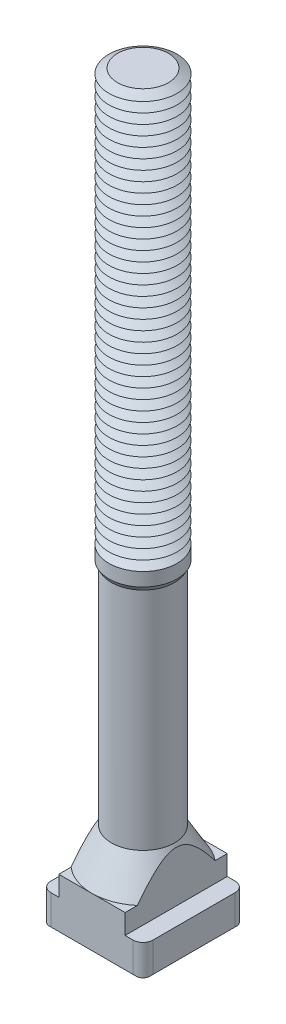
ISO-10303-21;
HEADER;
FILE_DESCRIPTION(('STEP AP214'),'2;1');
FILE_NAME('part.step','',(''),(''),'','','');
FILE_SCHEMA(('AUTOMOTIVE_DESIGN { 1 0 10303 214 1 1 1 1 }'));
ENDSEC;
DATA;
#1=APPLICATION_CONTEXT('core data for automotive mechanical design processes');
#2=APPLICATION_PROTOCOL_DEFINITION('international standard','automotive_design',2000,#1);
#3=PRODUCT_CONTEXT('',#1,'mechanical');
#4=PRODUCT('Part','Part','',(#3));
#5=PRODUCT_RELATED_PRODUCT_CATEGORY('part','',(#4));
#6=PRODUCT_DEFINITION_FORMATION('','',#4);
#7=PRODUCT_DEFINITION_CONTEXT('part definition',#1,'design');
#8=PRODUCT_DEFINITION('design','',#6,#7);
#9=PRODUCT_DEFINITION_SHAPE('','',#8);
#10=(LENGTH_UNIT() NAMED_UNIT(*) SI_UNIT(.MILLI.,.METRE.));
#11=(NAMED_UNIT(*) PLANE_ANGLE_UNIT() SI_UNIT($,.RADIAN.));
#12=(NAMED_UNIT(*) SI_UNIT($,.STERADIAN.) SOLID_ANGLE_UNIT());
#13=UNCERTAINTY_MEASURE_WITH_UNIT(LENGTH_MEASURE(1.E-05),#10,'distance_accuracy_value','');
#14=(GEOMETRIC_REPRESENTATION_CONTEXT(3) GLOBAL_UNCERTAINTY_ASSIGNED_CONTEXT((#13)) GLOBAL_UNIT_ASSIGNED_CONTEXT((#10,
#11,#12)) REPRESENTATION_CONTEXT('',''));
#15=CARTESIAN_POINT('',(0.,0.,0.));
#16=DIRECTION('',(0.,0.,1.));
#17=DIRECTION('',(1.,0.,0.));
#18=AXIS2_PLACEMENT_3D('',#15,#16,#17);
#19=CARTESIAN_POINT('',(0.,125.,0.));
#20=DIRECTION('',(0.,-1.,0.));
#21=DIRECTION('',(0.,0.,-1.));
#22=AXIS2_PLACEMENT_3D('',#19,#20,#21);
#23=CONICAL_SURFACE('',#22,4.48445554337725,1.04719755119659);
#24=CARTESIAN_POINT('',(0.,124.125,0.));
#25=DIRECTION('',(0.,-1.,0.));
#26=DIRECTION('',(0.,0.,-1.));
#27=AXIS2_PLACEMENT_3D('',#24,#25,#26);
#28=CIRCLE('',#27,6.00000000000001);
#29=CARTESIAN_POINT('',(0.,124.125,-6.00000000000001));
#30=VERTEX_POINT('',#29);
#31=EDGE_CURVE('E766',#30,#30,#28,.T.);
#32=ORIENTED_EDGE('',*,*,#31,.F.);
#33=EDGE_LOOP('',(#32));
#34=FACE_BOUND('',#33,.T.);
#35=CARTESIAN_POINT('',(0.,125.,0.));
#36=DIRECTION('',(0.,-1.,0.));
#37=DIRECTION('',(0.,0.,-1.));
#38=AXIS2_PLACEMENT_3D('',#35,#36,#37);
#39=CIRCLE('',#38,4.48445554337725);
#40=CARTESIAN_POINT('',(0.,125.,-4.48445554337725));
#41=VERTEX_POINT('',#40);
#42=EDGE_CURVE('E747',#41,#41,#39,.T.);
#43=ORIENTED_EDGE('',*,*,#42,.T.);
#44=EDGE_LOOP('',(#43));
#45=FACE_BOUND('',#44,.T.);
#46=ADVANCED_FACE('F39',(#34,#45),#23,.T.);
#47=CARTESIAN_POINT('',(0.,125.875,0.));
#48=DIRECTION('',(0.,1.,0.));
#49=DIRECTION('',(0.,0.,1.));
#50=AXIS2_PLACEMENT_3D('',#47,#48,#49);
#51=CONICAL_SURFACE('',#50,6.00000000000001,1.04719755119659);
#52=ORIENTED_EDGE('',*,*,#42,.F.);
#53=EDGE_LOOP('',(#52));
#54=FACE_BOUND('',#53,.T.);
#55=CARTESIAN_POINT('',(0.,125.875,0.));
#56=DIRECTION('',(0.,-1.,0.));
#57=DIRECTION('',(0.,0.,-1.));
#58=AXIS2_PLACEMENT_3D('',#55,#56,#57);
#59=CIRCLE('',#58,6.00000000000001);
#60=CARTESIAN_POINT('',(0.,125.875,-6.00000000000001));
#61=VERTEX_POINT('',#60);
#62=EDGE_CURVE('E745',#61,#61,#59,.T.);
#63=ORIENTED_EDGE('',*,*,#62,.T.);
#64=EDGE_LOOP('',(#63));
#65=FACE_BOUND('',#64,.T.);
#66=ADVANCED_FACE('F448',(#54,#65),#51,.T.);
#67=CARTESIAN_POINT('',(2.99984283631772,132.,0.));
#68=DIRECTION('',(0.,-1.,0.));
#69=DIRECTION('',(1.,0.,0.));
#70=AXIS2_PLACEMENT_3D('',#67,#68,#69);
#71=PLANE('',#70);
#72=CARTESIAN_POINT('',(0.,132.,0.));
#73=DIRECTION('',(0.,-1.,0.));
#74=DIRECTION('',(0.,0.,-1.));
#75=AXIS2_PLACEMENT_3D('',#72,#73,#74);
#76=CIRCLE('',#75,4.48445554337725);
#77=CARTESIAN_POINT('',(0.,132.,-4.48445554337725));
#78=VERTEX_POINT('',#77);
#79=EDGE_CURVE('E1887',#78,#78,#76,.T.);
#80=ORIENTED_EDGE('',*,*,#79,.F.);
#81=EDGE_LOOP('',(#80));
#82=FACE_BOUND('',#81,.T.);
#83=ADVANCED_FACE('F454',(#82),#71,.F.);
#84=CARTESIAN_POINT('',(0.,132.,0.));
#85=DIRECTION('',(0.,-1.,0.));
#86=DIRECTION('',(0.,0.,-1.));
#87=AXIS2_PLACEMENT_3D('',#84,#85,#86);
#88=CONICAL_SURFACE('',#87,4.48445554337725,1.04719755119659);
#89=CARTESIAN_POINT('',(0.,131.125,0.));
#90=DIRECTION('',(0.,-1.,0.));
#91=DIRECTION('',(0.,0.,-1.));
#92=AXIS2_PLACEMENT_3D('',#89,#90,#91);
#93=CIRCLE('',#92,6.00000000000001);
#94=CARTESIAN_POINT('',(0.,131.125,-6.00000000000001));
#95=VERTEX_POINT('',#94);
#96=EDGE_CURVE('E742',#95,#95,#93,.T.);
#97=ORIENTED_EDGE('',*,*,#96,.F.);
#98=EDGE_LOOP('',(#97));
#99=FACE_BOUND('',#98,.T.);
#100=ORIENTED_EDGE('',*,*,#79,.T.);
#101=EDGE_LOOP('',(#100));
#102=FACE_BOUND('',#101,.T.);
#103=ADVANCED_FACE('F482',(#99,#102),#88,.T.);
#104=CARTESIAN_POINT('',(0.,131.125,0.));
#105=DIRECTION('',(0.,1.,0.));
#106=DIRECTION('',(0.,0.,1.));
#107=AXIS2_PLACEMENT_3D('',#104,#105,#106);
#108=CONICAL_SURFACE('',#107,6.00000000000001,1.04719755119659);
#109=CARTESIAN_POINT('',(0.,130.25,0.));
#110=DIRECTION('',(0.,-1.,0.));
#111=DIRECTION('',(0.,0.,-1.));
#112=AXIS2_PLACEMENT_3D('',#109,#110,#111);
#113=CIRCLE('',#112,4.48445554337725);
#114=CARTESIAN_POINT('',(0.,130.25,-4.48445554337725));
#115=VERTEX_POINT('',#114);
#116=EDGE_CURVE('E739',#115,#115,#113,.T.);
#117=ORIENTED_EDGE('',*,*,#116,.F.);
#118=EDGE_LOOP('',(#117));
#119=FACE_BOUND('',#118,.T.);
#120=ORIENTED_EDGE('',*,*,#96,.T.);
#121=EDGE_LOOP('',(#120));
#122=FACE_BOUND('',#121,.T.);
#123=ADVANCED_FACE('F479',(#119,#122),#108,.T.);
#124=CARTESIAN_POINT('',(0.,130.25,0.));
#125=DIRECTION('',(0.,-1.,0.));
#126=DIRECTION('',(0.,0.,-1.));
#127=AXIS2_PLACEMENT_3D('',#124,#125,#126);
#128=CONICAL_SURFACE('',#127,4.48445554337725,1.04719755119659);
#129=CARTESIAN_POINT('',(0.,129.375,0.));
#130=DIRECTION('',(0.,-1.,0.));
#131=DIRECTION('',(0.,0.,-1.));
#132=AXIS2_PLACEMENT_3D('',#129,#130,#131);
#133=CIRCLE('',#132,6.00000000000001);
#134=CARTESIAN_POINT('',(0.,129.375,-6.00000000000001));
#135=VERTEX_POINT('',#134);
#136=EDGE_CURVE('E743',#135,#135,#133,.T.);
#137=ORIENTED_EDGE('',*,*,#136,.F.);
#138=EDGE_LOOP('',(#137));
#139=FACE_BOUND('',#138,.T.);
#140=ORIENTED_EDGE('',*,*,#116,.T.);
#141=EDGE_LOOP('',(#140));
#142=FACE_BOUND('',#141,.T.);
#143=ADVANCED_FACE('F474',(#139,#142),#128,.T.);
#144=CARTESIAN_POINT('',(0.,129.375,0.));
#145=DIRECTION('',(0.,1.,0.));
#146=DIRECTION('',(0.,0.,1.));
#147=AXIS2_PLACEMENT_3D('',#144,#145,#146);
#148=CONICAL_SURFACE('',#147,6.00000000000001,1.04719755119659);
#149=CARTESIAN_POINT('',(0.,128.5,0.));
#150=DIRECTION('',(0.,-1.,0.));
#151=DIRECTION('',(0.,0.,-1.));
#152=AXIS2_PLACEMENT_3D('',#149,#150,#151);
#153=CIRCLE('',#152,4.48445554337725);
#154=CARTESIAN_POINT('',(0.,128.5,-4.48445554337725));
#155=VERTEX_POINT('',#154);
#156=EDGE_CURVE('E682',#155,#155,#153,.T.);
#157=ORIENTED_EDGE('',*,*,#156,.F.);
#158=EDGE_LOOP('',(#157));
#159=FACE_BOUND('',#158,.T.);
#160=ORIENTED_EDGE('',*,*,#136,.T.);
#161=EDGE_LOOP('',(#160));
#162=FACE_BOUND('',#161,.T.);
#163=ADVANCED_FACE('F471',(#159,#162),#148,.T.);
#164=CARTESIAN_POINT('',(0.,128.5,0.));
#165=DIRECTION('',(0.,-1.,0.));
#166=DIRECTION('',(0.,0.,-1.));
#167=AXIS2_PLACEMENT_3D('',#164,#165,#166);
#168=CONICAL_SURFACE('',#167,4.48445554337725,1.04719755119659);
#169=CARTESIAN_POINT('',(0.,127.625,0.));
#170=DIRECTION('',(0.,-1.,0.));
#171=DIRECTION('',(0.,0.,-1.));
#172=AXIS2_PLACEMENT_3D('',#169,#170,#171);
#173=CIRCLE('',#172,6.00000000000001);
#174=CARTESIAN_POINT('',(0.,127.625,-6.00000000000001));
#175=VERTEX_POINT('',#174);
#176=EDGE_CURVE('E679',#175,#175,#173,.T.);
#177=ORIENTED_EDGE('',*,*,#176,.F.);
#178=EDGE_LOOP('',(#177));
#179=FACE_BOUND('',#178,.T.);
#180=ORIENTED_EDGE('',*,*,#156,.T.);
#181=EDGE_LOOP('',(#180));
#182=FACE_BOUND('',#181,.T.);
#183=ADVANCED_FACE('F465',(#179,#182),#168,.T.);
#184=CARTESIAN_POINT('',(0.,127.625,0.));
#185=DIRECTION('',(0.,1.,0.));
#186=DIRECTION('',(0.,0.,1.));
#187=AXIS2_PLACEMENT_3D('',#184,#185,#186);
#188=CONICAL_SURFACE('',#187,6.00000000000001,1.04719755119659);
#189=CARTESIAN_POINT('',(0.,126.75,0.));
#190=DIRECTION('',(0.,-1.,0.));
#191=DIRECTION('',(0.,0.,-1.));
#192=AXIS2_PLACEMENT_3D('',#189,#190,#191);
#193=CIRCLE('',#192,4.48445554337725);
#194=CARTESIAN_POINT('',(0.,126.75,-4.48445554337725));
#195=VERTEX_POINT('',#194);
#196=EDGE_CURVE('E683',#195,#195,#193,.T.);
#197=ORIENTED_EDGE('',*,*,#196,.F.);
#198=EDGE_LOOP('',(#197));
#199=FACE_BOUND('',#198,.T.);
#200=ORIENTED_EDGE('',*,*,#176,.T.);
#201=EDGE_LOOP('',(#200));
#202=FACE_BOUND('',#201,.T.);
#203=ADVANCED_FACE('F461',(#199,#202),#188,.T.);
#204=CARTESIAN_POINT('',(0.,126.75,0.));
#205=DIRECTION('',(0.,-1.,0.));
#206=DIRECTION('',(0.,0.,-1.));
#207=AXIS2_PLACEMENT_3D('',#204,#205,#206);
#208=CONICAL_SURFACE('',#207,4.48445554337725,1.04719755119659);
#209=ORIENTED_EDGE('',*,*,#62,.F.);
#210=EDGE_LOOP('',(#209));
#211=FACE_BOUND('',#210,.T.);
#212=ORIENTED_EDGE('',*,*,#196,.T.);
#213=EDGE_LOOP('',(#212));
#214=FACE_BOUND('',#213,.T.);
#215=ADVANCED_FACE('F464',(#211,#214),#208,.T.);
#216=CARTESIAN_POINT('',(0.,123.25,0.));
#217=DIRECTION('',(0.,-1.,0.));
#218=DIRECTION('',(0.,0.,-1.));
#219=AXIS2_PLACEMENT_3D('',#216,#217,#218);
#220=CONICAL_SURFACE('',#219,4.48445554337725,1.04719755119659);
#221=CARTESIAN_POINT('',(0.,122.375,0.));
#222=DIRECTION('',(0.,-1.,0.));
#223=DIRECTION('',(0.,0.,-1.));
#224=AXIS2_PLACEMENT_3D('',#221,#222,#223);
#225=CIRCLE('',#224,6.00000000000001);
#226=CARTESIAN_POINT('',(0.,122.375,-6.00000000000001));
#227=VERTEX_POINT('',#226);
#228=EDGE_CURVE('E1863',#227,#227,#225,.T.);
#229=ORIENTED_EDGE('',*,*,#228,.F.);
#230=EDGE_LOOP('',(#229));
#231=FACE_BOUND('',#230,.T.);
#232=CARTESIAN_POINT('',(0.,123.25,0.));
#233=DIRECTION('',(0.,-1.,0.));
#234=DIRECTION('',(0.,0.,-1.));
#235=AXIS2_PLACEMENT_3D('',#232,#233,#234);
#236=CIRCLE('',#235,4.48445554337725);
#237=CARTESIAN_POINT('',(0.,123.25,-4.48445554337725));
#238=VERTEX_POINT('',#237);
#239=EDGE_CURVE('E769',#238,#238,#236,.T.);
#240=ORIENTED_EDGE('',*,*,#239,.T.);
#241=EDGE_LOOP('',(#240));
#242=FACE_BOUND('',#241,.T.);
#243=ADVANCED_FACE('F469',(#231,#242),#220,.T.);
#244=CARTESIAN_POINT('',(0.,124.125,0.));
#245=DIRECTION('',(0.,1.,0.));
#246=DIRECTION('',(0.,0.,1.));
#247=AXIS2_PLACEMENT_3D('',#244,#245,#246);
#248=CONICAL_SURFACE('',#247,6.00000000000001,1.04719755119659);
#249=ORIENTED_EDGE('',*,*,#239,.F.);
#250=EDGE_LOOP('',(#249));
#251=FACE_BOUND('',#250,.T.);
#252=ORIENTED_EDGE('',*,*,#31,.T.);
#253=EDGE_LOOP('',(#252));
#254=FACE_BOUND('',#253,.T.);
#255=ADVANCED_FACE('F1521',(#251,#254),#248,.T.);
#256=CARTESIAN_POINT('',(0.,121.5,0.));
#257=DIRECTION('',(0.,-1.,0.));
#258=DIRECTION('',(0.,0.,-1.));
#259=AXIS2_PLACEMENT_3D('',#256,#257,#258);
#260=CONICAL_SURFACE('',#259,4.48445554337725,1.04719755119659);
#261=CARTESIAN_POINT('',(0.,120.625,0.));
#262=DIRECTION('',(0.,-1.,0.));
#263=DIRECTION('',(0.,0.,-1.));
#264=AXIS2_PLACEMENT_3D('',#261,#262,#263);
#265=CIRCLE('',#264,6.00000000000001);
#266=CARTESIAN_POINT('',(0.,120.625,-6.00000000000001));
#267=VERTEX_POINT('',#266);
#268=EDGE_CURVE('E736',#267,#267,#265,.T.);
#269=ORIENTED_EDGE('',*,*,#268,.F.);
#270=EDGE_LOOP('',(#269));
#271=FACE_BOUND('',#270,.T.);
#272=CARTESIAN_POINT('',(0.,121.5,0.));
#273=DIRECTION('',(0.,-1.,0.));
#274=DIRECTION('',(0.,0.,-1.));
#275=AXIS2_PLACEMENT_3D('',#272,#273,#274);
#276=CIRCLE('',#275,4.48445554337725);
#277=CARTESIAN_POINT('',(0.,121.5,-4.48445554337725));
#278=VERTEX_POINT('',#277);
#279=EDGE_CURVE('E631',#278,#278,#276,.T.);
#280=ORIENTED_EDGE('',*,*,#279,.T.);
#281=EDGE_LOOP('',(#280));
#282=FACE_BOUND('',#281,.T.);
#283=ADVANCED_FACE('F1511',(#271,#282),#260,.T.);
#284=CARTESIAN_POINT('',(0.,122.375,0.));
#285=DIRECTION('',(0.,1.,0.));
#286=DIRECTION('',(0.,0.,1.));
#287=AXIS2_PLACEMENT_3D('',#284,#285,#286);
#288=CONICAL_SURFACE('',#287,6.00000000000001,1.04719755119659);
#289=ORIENTED_EDGE('',*,*,#279,.F.);
#290=EDGE_LOOP('',(#289));
#291=FACE_BOUND('',#290,.T.);
#292=ORIENTED_EDGE('',*,*,#228,.T.);
#293=EDGE_LOOP('',(#292));
#294=FACE_BOUND('',#293,.T.);
#295=ADVANCED_FACE('F1501',(#291,#294),#288,.T.);
#296=CARTESIAN_POINT('',(0.,119.75,0.));
#297=DIRECTION('',(0.,-1.,0.));
#298=DIRECTION('',(0.,0.,-1.));
#299=AXIS2_PLACEMENT_3D('',#296,#297,#298);
#300=CONICAL_SURFACE('',#299,4.48445554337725,1.04719755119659);
#301=CARTESIAN_POINT('',(0.,118.875,0.));
#302=DIRECTION('',(0.,-1.,0.));
#303=DIRECTION('',(0.,0.,-1.));
#304=AXIS2_PLACEMENT_3D('',#301,#302,#303);
#305=CIRCLE('',#304,6.00000000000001);
#306=CARTESIAN_POINT('',(0.,118.875,-6.00000000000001));
#307=VERTEX_POINT('',#306);
#308=EDGE_CURVE('E737',#307,#307,#305,.T.);
#309=ORIENTED_EDGE('',*,*,#308,.F.);
#310=EDGE_LOOP('',(#309));
#311=FACE_BOUND('',#310,.T.);
#312=CARTESIAN_POINT('',(0.,119.75,0.));
#313=DIRECTION('',(0.,-1.,0.));
#314=DIRECTION('',(0.,0.,-1.));
#315=AXIS2_PLACEMENT_3D('',#312,#313,#314);
#316=CIRCLE('',#315,4.48445554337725);
#317=CARTESIAN_POINT('',(0.,119.75,-4.48445554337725));
#318=VERTEX_POINT('',#317);
#319=EDGE_CURVE('E733',#318,#318,#316,.T.);
#320=ORIENTED_EDGE('',*,*,#319,.T.);
#321=EDGE_LOOP('',(#320));
#322=FACE_BOUND('',#321,.T.);
#323=ADVANCED_FACE('F1491',(#311,#322),#300,.T.);
#324=CARTESIAN_POINT('',(0.,120.625,0.));
#325=DIRECTION('',(0.,1.,0.));
#326=DIRECTION('',(0.,0.,1.));
#327=AXIS2_PLACEMENT_3D('',#324,#325,#326);
#328=CONICAL_SURFACE('',#327,6.00000000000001,1.04719755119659);
#329=ORIENTED_EDGE('',*,*,#319,.F.);
#330=EDGE_LOOP('',(#329));
#331=FACE_BOUND('',#330,.T.);
#332=ORIENTED_EDGE('',*,*,#268,.T.);
#333=EDGE_LOOP('',(#332));
#334=FACE_BOUND('',#333,.T.);
#335=ADVANCED_FACE('F1481',(#331,#334),#328,.T.);
#336=CARTESIAN_POINT('',(0.,118.,0.));
#337=DIRECTION('',(0.,-1.,0.));
#338=DIRECTION('',(0.,0.,-1.));
#339=AXIS2_PLACEMENT_3D('',#336,#337,#338);
#340=CONICAL_SURFACE('',#339,4.48445554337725,1.04719755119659);
#341=CARTESIAN_POINT('',(0.,117.125,0.));
#342=DIRECTION('',(0.,-1.,0.));
#343=DIRECTION('',(0.,0.,-1.));
#344=AXIS2_PLACEMENT_3D('',#341,#342,#343);
#345=CIRCLE('',#344,6.00000000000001);
#346=CARTESIAN_POINT('',(0.,117.125,-6.00000000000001));
#347=VERTEX_POINT('',#346);
#348=EDGE_CURVE('E1976',#347,#347,#345,.T.);
#349=ORIENTED_EDGE('',*,*,#348,.F.);
#350=EDGE_LOOP('',(#349));
#351=FACE_BOUND('',#350,.T.);
#352=CARTESIAN_POINT('',(0.,118.,0.));
#353=DIRECTION('',(0.,-1.,0.));
#354=DIRECTION('',(0.,0.,-1.));
#355=AXIS2_PLACEMENT_3D('',#352,#353,#354);
#356=CIRCLE('',#355,4.48445554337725);
#357=CARTESIAN_POINT('',(0.,118.,-4.48445554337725));
#358=VERTEX_POINT('',#357);
#359=EDGE_CURVE('E764',#358,#358,#356,.T.);
#360=ORIENTED_EDGE('',*,*,#359,.T.);
#361=EDGE_LOOP('',(#360));
#362=FACE_BOUND('',#361,.T.);
#363=ADVANCED_FACE('F1471',(#351,#362),#340,.T.);
#364=CARTESIAN_POINT('',(0.,118.875,0.));
#365=DIRECTION('',(0.,1.,0.));
#366=DIRECTION('',(0.,0.,1.));
#367=AXIS2_PLACEMENT_3D('',#364,#365,#366);
#368=CONICAL_SURFACE('',#367,6.00000000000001,1.04719755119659);
#369=ORIENTED_EDGE('',*,*,#359,.F.);
#370=EDGE_LOOP('',(#369));
#371=FACE_BOUND('',#370,.T.);
#372=ORIENTED_EDGE('',*,*,#308,.T.);
#373=EDGE_LOOP('',(#372));
#374=FACE_BOUND('',#373,.T.);
#375=ADVANCED_FACE('F1461',(#371,#374),#368,.T.);
#376=CARTESIAN_POINT('',(0.,116.25,0.));
#377=DIRECTION('',(0.,-1.,0.));
#378=DIRECTION('',(0.,0.,-1.));
#379=AXIS2_PLACEMENT_3D('',#376,#377,#378);
#380=CONICAL_SURFACE('',#379,4.48445554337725,1.04719755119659);
#381=CARTESIAN_POINT('',(0.,115.375,0.));
#382=DIRECTION('',(0.,-1.,0.));
#383=DIRECTION('',(0.,0.,-1.));
#384=AXIS2_PLACEMENT_3D('',#381,#382,#383);
#385=CIRCLE('',#384,6.00000000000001);
#386=CARTESIAN_POINT('',(0.,115.375,-6.00000000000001));
#387=VERTEX_POINT('',#386);
#388=EDGE_CURVE('E699',#387,#387,#385,.T.);
#389=ORIENTED_EDGE('',*,*,#388,.F.);
#390=EDGE_LOOP('',(#389));
#391=FACE_BOUND('',#390,.T.);
#392=CARTESIAN_POINT('',(0.,116.25,0.));
#393=DIRECTION('',(0.,-1.,0.));
#394=DIRECTION('',(0.,0.,-1.));
#395=AXIS2_PLACEMENT_3D('',#392,#393,#394);
#396=CIRCLE('',#395,4.48445554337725);
#397=CARTESIAN_POINT('',(0.,116.25,-4.48445554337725));
#398=VERTEX_POINT('',#397);
#399=EDGE_CURVE('E702',#398,#398,#396,.T.);
#400=ORIENTED_EDGE('',*,*,#399,.T.);
#401=EDGE_LOOP('',(#400));
#402=FACE_BOUND('',#401,.T.);
#403=ADVANCED_FACE('F1451',(#391,#402),#380,.T.);
#404=CARTESIAN_POINT('',(0.,117.125,0.));
#405=DIRECTION('',(0.,1.,0.));
#406=DIRECTION('',(0.,0.,1.));
#407=AXIS2_PLACEMENT_3D('',#404,#405,#406);
#408=CONICAL_SURFACE('',#407,6.00000000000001,1.04719755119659);
#409=ORIENTED_EDGE('',*,*,#399,.F.);
#410=EDGE_LOOP('',(#409));
#411=FACE_BOUND('',#410,.T.);
#412=ORIENTED_EDGE('',*,*,#348,.T.);
#413=EDGE_LOOP('',(#412));
#414=FACE_BOUND('',#413,.T.);
#415=ADVANCED_FACE('F1441',(#411,#414),#408,.T.);
#416=CARTESIAN_POINT('',(0.,114.5,0.));
#417=DIRECTION('',(0.,-1.,0.));
#418=DIRECTION('',(0.,0.,-1.));
#419=AXIS2_PLACEMENT_3D('',#416,#417,#418);
#420=CONICAL_SURFACE('',#419,4.48445554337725,1.04719755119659);
#421=CARTESIAN_POINT('',(0.,113.625,0.));
#422=DIRECTION('',(0.,-1.,0.));
#423=DIRECTION('',(0.,0.,-1.));
#424=AXIS2_PLACEMENT_3D('',#421,#422,#423);
#425=CIRCLE('',#424,6.00000000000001);
#426=CARTESIAN_POINT('',(0.,113.625,-6.00000000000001));
#427=VERTEX_POINT('',#426);
#428=EDGE_CURVE('E697',#427,#427,#425,.T.);
#429=ORIENTED_EDGE('',*,*,#428,.F.);
#430=EDGE_LOOP('',(#429));
#431=FACE_BOUND('',#430,.T.);
#432=CARTESIAN_POINT('',(0.,114.5,0.));
#433=DIRECTION('',(0.,-1.,0.));
#434=DIRECTION('',(0.,0.,-1.));
#435=AXIS2_PLACEMENT_3D('',#432,#433,#434);
#436=CIRCLE('',#435,4.48445554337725);
#437=CARTESIAN_POINT('',(0.,114.5,-4.48445554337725));
#438=VERTEX_POINT('',#437);
#439=EDGE_CURVE('E703',#438,#438,#436,.T.);
#440=ORIENTED_EDGE('',*,*,#439,.T.);
#441=EDGE_LOOP('',(#440));
#442=FACE_BOUND('',#441,.T.);
#443=ADVANCED_FACE('F1431',(#431,#442),#420,.T.);
#444=CARTESIAN_POINT('',(0.,115.375,0.));
#445=DIRECTION('',(0.,1.,0.));
#446=DIRECTION('',(0.,0.,1.));
#447=AXIS2_PLACEMENT_3D('',#444,#445,#446);
#448=CONICAL_SURFACE('',#447,6.00000000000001,1.04719755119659);
#449=ORIENTED_EDGE('',*,*,#439,.F.);
#450=EDGE_LOOP('',(#449));
#451=FACE_BOUND('',#450,.T.);
#452=ORIENTED_EDGE('',*,*,#388,.T.);
#453=EDGE_LOOP('',(#452));
#454=FACE_BOUND('',#453,.T.);
#455=ADVANCED_FACE('F1421',(#451,#454),#448,.T.);
#456=CARTESIAN_POINT('',(0.,112.75,0.));
#457=DIRECTION('',(0.,-1.,0.));
#458=DIRECTION('',(0.,0.,-1.));
#459=AXIS2_PLACEMENT_3D('',#456,#457,#458);
#460=CONICAL_SURFACE('',#459,4.48445554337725,1.04719755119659);
#461=CARTESIAN_POINT('',(0.,111.875,0.));
#462=DIRECTION('',(0.,-1.,0.));
#463=DIRECTION('',(0.,0.,-1.));
#464=AXIS2_PLACEMENT_3D('',#461,#462,#463);
#465=CIRCLE('',#464,6.00000000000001);
#466=CARTESIAN_POINT('',(0.,111.875,-6.00000000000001));
#467=VERTEX_POINT('',#466);
#468=EDGE_CURVE('E646',#467,#467,#465,.T.);
#469=ORIENTED_EDGE('',*,*,#468,.F.);
#470=EDGE_LOOP('',(#469));
#471=FACE_BOUND('',#470,.T.);
#472=CARTESIAN_POINT('',(0.,112.75,0.));
#473=DIRECTION('',(0.,-1.,0.));
#474=DIRECTION('',(0.,0.,-1.));
#475=AXIS2_PLACEMENT_3D('',#472,#473,#474);
#476=CIRCLE('',#475,4.48445554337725);
#477=CARTESIAN_POINT('',(0.,112.75,-4.48445554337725));
#478=VERTEX_POINT('',#477);
#479=EDGE_CURVE('E649',#478,#478,#476,.T.);
#480=ORIENTED_EDGE('',*,*,#479,.T.);
#481=EDGE_LOOP('',(#480));
#482=FACE_BOUND('',#481,.T.);
#483=ADVANCED_FACE('F1411',(#471,#482),#460,.T.);
#484=CARTESIAN_POINT('',(0.,113.625,0.));
#485=DIRECTION('',(0.,1.,0.));
#486=DIRECTION('',(0.,0.,1.));
#487=AXIS2_PLACEMENT_3D('',#484,#485,#486);
#488=CONICAL_SURFACE('',#487,6.00000000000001,1.04719755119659);
#489=ORIENTED_EDGE('',*,*,#479,.F.);
#490=EDGE_LOOP('',(#489));
#491=FACE_BOUND('',#490,.T.);
#492=ORIENTED_EDGE('',*,*,#428,.T.);
#493=EDGE_LOOP('',(#492));
#494=FACE_BOUND('',#493,.T.);
#495=ADVANCED_FACE('F1401',(#491,#494),#488,.T.);
#496=CARTESIAN_POINT('',(0.,111.,0.));
#497=DIRECTION('',(0.,-1.,0.));
#498=DIRECTION('',(0.,0.,-1.));
#499=AXIS2_PLACEMENT_3D('',#496,#497,#498);
#500=CONICAL_SURFACE('',#499,4.48445554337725,1.04719755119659);
#501=CARTESIAN_POINT('',(0.,110.125,0.));
#502=DIRECTION('',(0.,-1.,0.));
#503=DIRECTION('',(0.,0.,-1.));
#504=AXIS2_PLACEMENT_3D('',#501,#502,#503);
#505=CIRCLE('',#504,6.00000000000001);
#506=CARTESIAN_POINT('',(0.,110.125,-6.00000000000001));
#507=VERTEX_POINT('',#506);
#508=EDGE_CURVE('E1964',#507,#507,#505,.T.);
#509=ORIENTED_EDGE('',*,*,#508,.F.);
#510=EDGE_LOOP('',(#509));
#511=FACE_BOUND('',#510,.T.);
#512=CARTESIAN_POINT('',(0.,111.,0.));
#513=DIRECTION('',(0.,-1.,0.));
#514=DIRECTION('',(0.,0.,-1.));
#515=AXIS2_PLACEMENT_3D('',#512,#513,#514);
#516=CIRCLE('',#515,4.48445554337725);
#517=CARTESIAN_POINT('',(0.,111.,-4.48445554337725));
#518=VERTEX_POINT('',#517);
#519=EDGE_CURVE('E650',#518,#518,#516,.T.);
#520=ORIENTED_EDGE('',*,*,#519,.T.);
#521=EDGE_LOOP('',(#520));
#522=FACE_BOUND('',#521,.T.);
#523=ADVANCED_FACE('F1391',(#511,#522),#500,.T.);
#524=CARTESIAN_POINT('',(0.,111.875,0.));
#525=DIRECTION('',(0.,1.,0.));
#526=DIRECTION('',(0.,0.,1.));
#527=AXIS2_PLACEMENT_3D('',#524,#525,#526);
#528=CONICAL_SURFACE('',#527,6.00000000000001,1.04719755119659);
#529=ORIENTED_EDGE('',*,*,#519,.F.);
#530=EDGE_LOOP('',(#529));
#531=FACE_BOUND('',#530,.T.);
#532=ORIENTED_EDGE('',*,*,#468,.T.);
#533=EDGE_LOOP('',(#532));
#534=FACE_BOUND('',#533,.T.);
#535=ADVANCED_FACE('F1381',(#531,#534),#528,.T.);
#536=CARTESIAN_POINT('',(0.,109.25,0.));
#537=DIRECTION('',(0.,-1.,0.));
#538=DIRECTION('',(0.,0.,-1.));
#539=AXIS2_PLACEMENT_3D('',#536,#537,#538);
#540=CONICAL_SURFACE('',#539,4.48445554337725,1.04719755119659);
#541=CARTESIAN_POINT('',(0.,108.375,0.));
#542=DIRECTION('',(0.,-1.,0.));
#543=DIRECTION('',(0.,0.,-1.));
#544=AXIS2_PLACEMENT_3D('',#541,#542,#543);
#545=CIRCLE('',#544,6.00000000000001);
#546=CARTESIAN_POINT('',(0.,108.375,-6.00000000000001));
#547=VERTEX_POINT('',#546);
#548=EDGE_CURVE('E1957',#547,#547,#545,.T.);
#549=ORIENTED_EDGE('',*,*,#548,.F.);
#550=EDGE_LOOP('',(#549));
#551=FACE_BOUND('',#550,.T.);
#552=CARTESIAN_POINT('',(0.,109.25,0.));
#553=DIRECTION('',(0.,-1.,0.));
#554=DIRECTION('',(0.,0.,-1.));
#555=AXIS2_PLACEMENT_3D('',#552,#553,#554);
#556=CIRCLE('',#555,4.48445554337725);
#557=CARTESIAN_POINT('',(0.,109.25,-4.48445554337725));
#558=VERTEX_POINT('',#557);
#559=EDGE_CURVE('E1960',#558,#558,#556,.T.);
#560=ORIENTED_EDGE('',*,*,#559,.T.);
#561=EDGE_LOOP('',(#560));
#562=FACE_BOUND('',#561,.T.);
#563=ADVANCED_FACE('F1371',(#551,#562),#540,.T.);
#564=CARTESIAN_POINT('',(0.,110.125,0.));
#565=DIRECTION('',(0.,1.,0.));
#566=DIRECTION('',(0.,0.,1.));
#567=AXIS2_PLACEMENT_3D('',#564,#565,#566);
#568=CONICAL_SURFACE('',#567,6.00000000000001,1.04719755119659);
#569=ORIENTED_EDGE('',*,*,#559,.F.);
#570=EDGE_LOOP('',(#569));
#571=FACE_BOUND('',#570,.T.);
#572=ORIENTED_EDGE('',*,*,#508,.T.);
#573=EDGE_LOOP('',(#572));
#574=FACE_BOUND('',#573,.T.);
#575=ADVANCED_FACE('F1361',(#571,#574),#568,.T.);
#576=CARTESIAN_POINT('',(0.,107.5,0.));
#577=DIRECTION('',(0.,-1.,0.));
#578=DIRECTION('',(0.,0.,-1.));
#579=AXIS2_PLACEMENT_3D('',#576,#577,#578);
#580=CONICAL_SURFACE('',#579,4.48445554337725,1.04719755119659);
#581=CARTESIAN_POINT('',(0.,106.625,0.));
#582=DIRECTION('',(0.,-1.,0.));
#583=DIRECTION('',(0.,0.,-1.));
#584=AXIS2_PLACEMENT_3D('',#581,#582,#583);
#585=CIRCLE('',#584,6.00000000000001);
#586=CARTESIAN_POINT('',(0.,106.625,-6.00000000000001));
#587=VERTEX_POINT('',#586);
#588=EDGE_CURVE('E727',#587,#587,#585,.T.);
#589=ORIENTED_EDGE('',*,*,#588,.F.);
#590=EDGE_LOOP('',(#589));
#591=FACE_BOUND('',#590,.T.);
#592=CARTESIAN_POINT('',(0.,107.5,0.));
#593=DIRECTION('',(0.,-1.,0.));
#594=DIRECTION('',(0.,0.,-1.));
#595=AXIS2_PLACEMENT_3D('',#592,#593,#594);
#596=CIRCLE('',#595,4.48445554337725);
#597=CARTESIAN_POINT('',(0.,107.5,-4.48445554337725));
#598=VERTEX_POINT('',#597);
#599=EDGE_CURVE('E730',#598,#598,#596,.T.);
#600=ORIENTED_EDGE('',*,*,#599,.T.);
#601=EDGE_LOOP('',(#600));
#602=FACE_BOUND('',#601,.T.);
#603=ADVANCED_FACE('F1351',(#591,#602),#580,.T.);
#604=CARTESIAN_POINT('',(0.,108.375,0.));
#605=DIRECTION('',(0.,1.,0.));
#606=DIRECTION('',(0.,0.,1.));
#607=AXIS2_PLACEMENT_3D('',#604,#605,#606);
#608=CONICAL_SURFACE('',#607,6.00000000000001,1.04719755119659);
#609=ORIENTED_EDGE('',*,*,#599,.F.);
#610=EDGE_LOOP('',(#609));
#611=FACE_BOUND('',#610,.T.);
#612=ORIENTED_EDGE('',*,*,#548,.T.);
#613=EDGE_LOOP('',(#612));
#614=FACE_BOUND('',#613,.T.);
#615=ADVANCED_FACE('F1341',(#611,#614),#608,.T.);
#616=CARTESIAN_POINT('',(0.,105.75,0.));
#617=DIRECTION('',(0.,-1.,0.));
#618=DIRECTION('',(0.,0.,-1.));
#619=AXIS2_PLACEMENT_3D('',#616,#617,#618);
#620=CONICAL_SURFACE('',#619,4.48445554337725,1.04719755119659);
#621=CARTESIAN_POINT('',(0.,104.875,0.));
#622=DIRECTION('',(0.,-1.,0.));
#623=DIRECTION('',(0.,0.,-1.));
#624=AXIS2_PLACEMENT_3D('',#621,#622,#623);
#625=CIRCLE('',#624,6.00000000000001);
#626=CARTESIAN_POINT('',(0.,104.875,-6.00000000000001));
#627=VERTEX_POINT('',#626);
#628=EDGE_CURVE('E1920',#627,#627,#625,.T.);
#629=ORIENTED_EDGE('',*,*,#628,.F.);
#630=EDGE_LOOP('',(#629));
#631=FACE_BOUND('',#630,.T.);
#632=CARTESIAN_POINT('',(0.,105.75,0.));
#633=DIRECTION('',(0.,-1.,0.));
#634=DIRECTION('',(0.,0.,-1.));
#635=AXIS2_PLACEMENT_3D('',#632,#633,#634);
#636=CIRCLE('',#635,4.48445554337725);
#637=CARTESIAN_POINT('',(0.,105.75,-4.48445554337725));
#638=VERTEX_POINT('',#637);
#639=EDGE_CURVE('E731',#638,#638,#636,.T.);
#640=ORIENTED_EDGE('',*,*,#639,.T.);
#641=EDGE_LOOP('',(#640));
#642=FACE_BOUND('',#641,.T.);
#643=ADVANCED_FACE('F1331',(#631,#642),#620,.T.);
#644=CARTESIAN_POINT('',(0.,106.625,0.));
#645=DIRECTION('',(0.,1.,0.));
#646=DIRECTION('',(0.,0.,1.));
#647=AXIS2_PLACEMENT_3D('',#644,#645,#646);
#648=CONICAL_SURFACE('',#647,6.00000000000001,1.04719755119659);
#649=ORIENTED_EDGE('',*,*,#639,.F.);
#650=EDGE_LOOP('',(#649));
#651=FACE_BOUND('',#650,.T.);
#652=ORIENTED_EDGE('',*,*,#588,.T.);
#653=EDGE_LOOP('',(#652));
#654=FACE_BOUND('',#653,.T.);
#655=ADVANCED_FACE('F1321',(#651,#654),#648,.T.);
#656=CARTESIAN_POINT('',(0.,104.,0.));
#657=DIRECTION('',(0.,-1.,0.));
#658=DIRECTION('',(0.,0.,-1.));
#659=AXIS2_PLACEMENT_3D('',#656,#657,#658);
#660=CONICAL_SURFACE('',#659,4.48445554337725,1.04719755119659);
#661=CARTESIAN_POINT('',(0.,103.125,0.));
#662=DIRECTION('',(0.,-1.,0.));
#663=DIRECTION('',(0.,0.,-1.));
#664=AXIS2_PLACEMENT_3D('',#661,#662,#663);
#665=CIRCLE('',#664,6.00000000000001);
#666=CARTESIAN_POINT('',(0.,103.125,-6.00000000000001));
#667=VERTEX_POINT('',#666);
#668=EDGE_CURVE('E673',#667,#667,#665,.T.);
#669=ORIENTED_EDGE('',*,*,#668,.F.);
#670=EDGE_LOOP('',(#669));
#671=FACE_BOUND('',#670,.T.);
#672=CARTESIAN_POINT('',(0.,104.,0.));
#673=DIRECTION('',(0.,-1.,0.));
#674=DIRECTION('',(0.,0.,-1.));
#675=AXIS2_PLACEMENT_3D('',#672,#673,#674);
#676=CIRCLE('',#675,4.48445554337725);
#677=CARTESIAN_POINT('',(0.,104.,-4.48445554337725));
#678=VERTEX_POINT('',#677);
#679=EDGE_CURVE('E676',#678,#678,#676,.T.);
#680=ORIENTED_EDGE('',*,*,#679,.T.);
#681=EDGE_LOOP('',(#680));
#682=FACE_BOUND('',#681,.T.);
#683=ADVANCED_FACE('F1311',(#671,#682),#660,.T.);
#684=CARTESIAN_POINT('',(0.,104.875,0.));
#685=DIRECTION('',(0.,1.,0.));
#686=DIRECTION('',(0.,0.,1.));
#687=AXIS2_PLACEMENT_3D('',#684,#685,#686);
#688=CONICAL_SURFACE('',#687,6.00000000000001,1.04719755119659);
#689=ORIENTED_EDGE('',*,*,#679,.F.);
#690=EDGE_LOOP('',(#689));
#691=FACE_BOUND('',#690,.T.);
#692=ORIENTED_EDGE('',*,*,#628,.T.);
#693=EDGE_LOOP('',(#692));
#694=FACE_BOUND('',#693,.T.);
#695=ADVANCED_FACE('F1301',(#691,#694),#688,.T.);
#696=CARTESIAN_POINT('',(0.,102.25,0.));
#697=DIRECTION('',(0.,-1.,0.));
#698=DIRECTION('',(0.,0.,-1.));
#699=AXIS2_PLACEMENT_3D('',#696,#697,#698);
#700=CONICAL_SURFACE('',#699,4.48445554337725,1.04719755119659);
#701=CARTESIAN_POINT('',(0.,101.375,0.));
#702=DIRECTION('',(0.,-1.,0.));
#703=DIRECTION('',(0.,0.,-1.));
#704=AXIS2_PLACEMENT_3D('',#701,#702,#703);
#705=CIRCLE('',#704,6.00000000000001);
#706=CARTESIAN_POINT('',(0.,101.375,-6.00000000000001));
#707=VERTEX_POINT('',#706);
#708=EDGE_CURVE('E759',#707,#707,#705,.T.);
#709=ORIENTED_EDGE('',*,*,#708,.F.);
#710=EDGE_LOOP('',(#709));
#711=FACE_BOUND('',#710,.T.);
#712=CARTESIAN_POINT('',(0.,102.25,0.));
#713=DIRECTION('',(0.,-1.,0.));
#714=DIRECTION('',(0.,0.,-1.));
#715=AXIS2_PLACEMENT_3D('',#712,#713,#714);
#716=CIRCLE('',#715,4.48445554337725);
#717=CARTESIAN_POINT('',(0.,102.25,-4.48445554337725));
#718=VERTEX_POINT('',#717);
#719=EDGE_CURVE('E677',#718,#718,#716,.T.);
#720=ORIENTED_EDGE('',*,*,#719,.T.);
#721=EDGE_LOOP('',(#720));
#722=FACE_BOUND('',#721,.T.);
#723=ADVANCED_FACE('F1291',(#711,#722),#700,.T.);
#724=CARTESIAN_POINT('',(0.,103.125,0.));
#725=DIRECTION('',(0.,1.,0.));
#726=DIRECTION('',(0.,0.,1.));
#727=AXIS2_PLACEMENT_3D('',#724,#725,#726);
#728=CONICAL_SURFACE('',#727,6.00000000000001,1.04719755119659);
#729=ORIENTED_EDGE('',*,*,#719,.F.);
#730=EDGE_LOOP('',(#729));
#731=FACE_BOUND('',#730,.T.);
#732=ORIENTED_EDGE('',*,*,#668,.T.);
#733=EDGE_LOOP('',(#732));
#734=FACE_BOUND('',#733,.T.);
#735=ADVANCED_FACE('F1281',(#731,#734),#728,.T.);
#736=CARTESIAN_POINT('',(0.,100.5,0.));
#737=DIRECTION('',(0.,-1.,0.));
#738=DIRECTION('',(0.,0.,-1.));
#739=AXIS2_PLACEMENT_3D('',#736,#737,#738);
#740=CONICAL_SURFACE('',#739,4.48445554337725,1.04719755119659);
#741=CARTESIAN_POINT('',(0.,99.625,0.));
#742=DIRECTION('',(0.,-1.,0.));
#743=DIRECTION('',(0.,0.,-1.));
#744=AXIS2_PLACEMENT_3D('',#741,#742,#743);
#745=CIRCLE('',#744,6.00000000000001);
#746=CARTESIAN_POINT('',(0.,99.625,-6.00000000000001));
#747=VERTEX_POINT('',#746);
#748=EDGE_CURVE('E760',#747,#747,#745,.T.);
#749=ORIENTED_EDGE('',*,*,#748,.F.);
#750=EDGE_LOOP('',(#749));
#751=FACE_BOUND('',#750,.T.);
#752=CARTESIAN_POINT('',(0.,100.5,0.));
#753=DIRECTION('',(0.,-1.,0.));
#754=DIRECTION('',(0.,0.,-1.));
#755=AXIS2_PLACEMENT_3D('',#752,#753,#754);
#756=CIRCLE('',#755,4.48445554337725);
#757=CARTESIAN_POINT('',(0.,100.5,-4.48445554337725));
#758=VERTEX_POINT('',#757);
#759=EDGE_CURVE('E756',#758,#758,#756,.T.);
#760=ORIENTED_EDGE('',*,*,#759,.T.);
#761=EDGE_LOOP('',(#760));
#762=FACE_BOUND('',#761,.T.);
#763=ADVANCED_FACE('F1271',(#751,#762),#740,.T.);
#764=CARTESIAN_POINT('',(0.,101.375,0.));
#765=DIRECTION('',(0.,1.,0.));
#766=DIRECTION('',(0.,0.,1.));
#767=AXIS2_PLACEMENT_3D('',#764,#765,#766);
#768=CONICAL_SURFACE('',#767,6.00000000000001,1.04719755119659);
#769=ORIENTED_EDGE('',*,*,#759,.F.);
#770=EDGE_LOOP('',(#769));
#771=FACE_BOUND('',#770,.T.);
#772=ORIENTED_EDGE('',*,*,#708,.T.);
#773=EDGE_LOOP('',(#772));
#774=FACE_BOUND('',#773,.T.);
#775=ADVANCED_FACE('F1261',(#771,#774),#768,.T.);
#776=CARTESIAN_POINT('',(0.,98.75,0.));
#777=DIRECTION('',(0.,-1.,0.));
#778=DIRECTION('',(0.,0.,-1.));
#779=AXIS2_PLACEMENT_3D('',#776,#777,#778);
#780=CONICAL_SURFACE('',#779,4.48445554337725,1.04719755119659);
#781=CARTESIAN_POINT('',(0.,97.875,0.));
#782=DIRECTION('',(0.,-1.,0.));
#783=DIRECTION('',(0.,0.,-1.));
#784=AXIS2_PLACEMENT_3D('',#781,#782,#783);
#785=CIRCLE('',#784,6.00000000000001);
#786=CARTESIAN_POINT('',(0.,97.875,-6.00000000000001));
#787=VERTEX_POINT('',#786);
#788=EDGE_CURVE('E643',#787,#787,#785,.T.);
#789=ORIENTED_EDGE('',*,*,#788,.F.);
#790=EDGE_LOOP('',(#789));
#791=FACE_BOUND('',#790,.T.);
#792=CARTESIAN_POINT('',(0.,98.75,0.));
#793=DIRECTION('',(0.,-1.,0.));
#794=DIRECTION('',(0.,0.,-1.));
#795=AXIS2_PLACEMENT_3D('',#792,#793,#794);
#796=CIRCLE('',#795,4.48445554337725);
#797=CARTESIAN_POINT('',(0.,98.75,-4.48445554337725));
#798=VERTEX_POINT('',#797);
#799=EDGE_CURVE('E1900',#798,#798,#796,.T.);
#800=ORIENTED_EDGE('',*,*,#799,.T.);
#801=EDGE_LOOP('',(#800));
#802=FACE_BOUND('',#801,.T.);
#803=ADVANCED_FACE('F1251',(#791,#802),#780,.T.);
#804=CARTESIAN_POINT('',(0.,99.625,0.));
#805=DIRECTION('',(0.,1.,0.));
#806=DIRECTION('',(0.,0.,1.));
#807=AXIS2_PLACEMENT_3D('',#804,#805,#806);
#808=CONICAL_SURFACE('',#807,6.00000000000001,1.04719755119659);
#809=ORIENTED_EDGE('',*,*,#799,.F.);
#810=EDGE_LOOP('',(#809));
#811=FACE_BOUND('',#810,.T.);
#812=ORIENTED_EDGE('',*,*,#748,.T.);
#813=EDGE_LOOP('',(#812));
#814=FACE_BOUND('',#813,.T.);
#815=ADVANCED_FACE('F1241',(#811,#814),#808,.T.);
#816=CARTESIAN_POINT('',(0.,97.,0.));
#817=DIRECTION('',(0.,-1.,0.));
#818=DIRECTION('',(0.,0.,-1.));
#819=AXIS2_PLACEMENT_3D('',#816,#817,#818);
#820=CONICAL_SURFACE('',#819,4.48445554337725,1.04719755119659);
#821=CARTESIAN_POINT('',(0.,96.125,0.));
#822=DIRECTION('',(0.,-1.,0.));
#823=DIRECTION('',(0.,0.,-1.));
#824=AXIS2_PLACEMENT_3D('',#821,#822,#823);
#825=CIRCLE('',#824,6.00000000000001);
#826=CARTESIAN_POINT('',(0.,96.125,-6.00000000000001));
#827=VERTEX_POINT('',#826);
#828=EDGE_CURVE('E644',#827,#827,#825,.T.);
#829=ORIENTED_EDGE('',*,*,#828,.F.);
#830=EDGE_LOOP('',(#829));
#831=FACE_BOUND('',#830,.T.);
#832=CARTESIAN_POINT('',(0.,97.,0.));
#833=DIRECTION('',(0.,-1.,0.));
#834=DIRECTION('',(0.,0.,-1.));
#835=AXIS2_PLACEMENT_3D('',#832,#833,#834);
#836=CIRCLE('',#835,4.48445554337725);
#837=CARTESIAN_POINT('',(0.,97.,-4.48445554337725));
#838=VERTEX_POINT('',#837);
#839=EDGE_CURVE('E640',#838,#838,#836,.T.);
#840=ORIENTED_EDGE('',*,*,#839,.T.);
#841=EDGE_LOOP('',(#840));
#842=FACE_BOUND('',#841,.T.);
#843=ADVANCED_FACE('F1231',(#831,#842),#820,.T.);
#844=CARTESIAN_POINT('',(0.,97.875,0.));
#845=DIRECTION('',(0.,1.,0.));
#846=DIRECTION('',(0.,0.,1.));
#847=AXIS2_PLACEMENT_3D('',#844,#845,#846);
#848=CONICAL_SURFACE('',#847,6.00000000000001,1.04719755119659);
#849=ORIENTED_EDGE('',*,*,#839,.F.);
#850=EDGE_LOOP('',(#849));
#851=FACE_BOUND('',#850,.T.);
#852=ORIENTED_EDGE('',*,*,#788,.T.);
#853=EDGE_LOOP('',(#852));
#854=FACE_BOUND('',#853,.T.);
#855=ADVANCED_FACE('F1221',(#851,#854),#848,.T.);
#856=CARTESIAN_POINT('',(0.,95.25,0.));
#857=DIRECTION('',(0.,-1.,0.));
#858=DIRECTION('',(0.,0.,-1.));
#859=AXIS2_PLACEMENT_3D('',#856,#857,#858);
#860=CONICAL_SURFACE('',#859,4.48445554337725,1.04719755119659);
#861=CARTESIAN_POINT('',(0.,94.375,0.));
#862=DIRECTION('',(0.,-1.,0.));
#863=DIRECTION('',(0.,0.,-1.));
#864=AXIS2_PLACEMENT_3D('',#861,#862,#863);
#865=CIRCLE('',#864,6.00000000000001);
#866=CARTESIAN_POINT('',(0.,94.375,-6.00000000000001));
#867=VERTEX_POINT('',#866);
#868=EDGE_CURVE('E2014',#867,#867,#865,.T.);
#869=ORIENTED_EDGE('',*,*,#868,.F.);
#870=EDGE_LOOP('',(#869));
#871=FACE_BOUND('',#870,.T.);
#872=CARTESIAN_POINT('',(0.,95.25,0.));
#873=DIRECTION('',(0.,-1.,0.));
#874=DIRECTION('',(0.,0.,-1.));
#875=AXIS2_PLACEMENT_3D('',#872,#873,#874);
#876=CIRCLE('',#875,4.48445554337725);
#877=CARTESIAN_POINT('',(0.,95.25,-4.48445554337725));
#878=VERTEX_POINT('',#877);
#879=EDGE_CURVE('E1916',#878,#878,#876,.T.);
#880=ORIENTED_EDGE('',*,*,#879,.T.);
#881=EDGE_LOOP('',(#880));
#882=FACE_BOUND('',#881,.T.);
#883=ADVANCED_FACE('F1211',(#871,#882),#860,.T.);
#884=CARTESIAN_POINT('',(0.,96.125,0.));
#885=DIRECTION('',(0.,1.,0.));
#886=DIRECTION('',(0.,0.,1.));
#887=AXIS2_PLACEMENT_3D('',#884,#885,#886);
#888=CONICAL_SURFACE('',#887,6.00000000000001,1.04719755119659);
#889=ORIENTED_EDGE('',*,*,#879,.F.);
#890=EDGE_LOOP('',(#889));
#891=FACE_BOUND('',#890,.T.);
#892=ORIENTED_EDGE('',*,*,#828,.T.);
#893=EDGE_LOOP('',(#892));
#894=FACE_BOUND('',#893,.T.);
#895=ADVANCED_FACE('F1201',(#891,#894),#888,.T.);
#896=CARTESIAN_POINT('',(0.,93.5,0.));
#897=DIRECTION('',(0.,-1.,0.));
#898=DIRECTION('',(0.,0.,-1.));
#899=AXIS2_PLACEMENT_3D('',#896,#897,#898);
#900=CONICAL_SURFACE('',#899,4.48445554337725,1.04719755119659);
#901=CARTESIAN_POINT('',(0.,92.625,0.));
#902=DIRECTION('',(0.,-1.,0.));
#903=DIRECTION('',(0.,0.,-1.));
#904=AXIS2_PLACEMENT_3D('',#901,#902,#903);
#905=CIRCLE('',#904,6.00000000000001);
#906=CARTESIAN_POINT('',(0.,92.625,-6.00000000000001));
#907=VERTEX_POINT('',#906);
#908=EDGE_CURVE('E2015',#907,#907,#905,.T.);
#909=ORIENTED_EDGE('',*,*,#908,.F.);
#910=EDGE_LOOP('',(#909));
#911=FACE_BOUND('',#910,.T.);
#912=CARTESIAN_POINT('',(0.,93.5,0.));
#913=DIRECTION('',(0.,-1.,0.));
#914=DIRECTION('',(0.,0.,-1.));
#915=AXIS2_PLACEMENT_3D('',#912,#913,#914);
#916=CIRCLE('',#915,4.48445554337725);
#917=CARTESIAN_POINT('',(0.,93.5,-4.48445554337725));
#918=VERTEX_POINT('',#917);
#919=EDGE_CURVE('E2012',#918,#918,#916,.T.);
#920=ORIENTED_EDGE('',*,*,#919,.T.);
#921=EDGE_LOOP('',(#920));
#922=FACE_BOUND('',#921,.T.);
#923=ADVANCED_FACE('F1191',(#911,#922),#900,.T.);
#924=CARTESIAN_POINT('',(0.,94.375,0.));
#925=DIRECTION('',(0.,1.,0.));
#926=DIRECTION('',(0.,0.,1.));
#927=AXIS2_PLACEMENT_3D('',#924,#925,#926);
#928=CONICAL_SURFACE('',#927,6.00000000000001,1.04719755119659);
#929=ORIENTED_EDGE('',*,*,#919,.F.);
#930=EDGE_LOOP('',(#929));
#931=FACE_BOUND('',#930,.T.);
#932=ORIENTED_EDGE('',*,*,#868,.T.);
#933=EDGE_LOOP('',(#932));
#934=FACE_BOUND('',#933,.T.);
#935=ADVANCED_FACE('F1181',(#931,#934),#928,.T.);
#936=CARTESIAN_POINT('',(0.,91.75,0.));
#937=DIRECTION('',(0.,-1.,0.));
#938=DIRECTION('',(0.,0.,-1.));
#939=AXIS2_PLACEMENT_3D('',#936,#937,#938);
#940=CONICAL_SURFACE('',#939,4.48445554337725,1.04719755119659);
#941=CARTESIAN_POINT('',(0.,90.875,0.));
#942=DIRECTION('',(0.,-1.,0.));
#943=DIRECTION('',(0.,0.,-1.));
#944=AXIS2_PLACEMENT_3D('',#941,#942,#943);
#945=CIRCLE('',#944,6.00000000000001);
#946=CARTESIAN_POINT('',(0.,90.875,-6.00000000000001));
#947=VERTEX_POINT('',#946);
#948=EDGE_CURVE('E721',#947,#947,#945,.T.);
#949=ORIENTED_EDGE('',*,*,#948,.F.);
#950=EDGE_LOOP('',(#949));
#951=FACE_BOUND('',#950,.T.);
#952=CARTESIAN_POINT('',(0.,91.75,0.));
#953=DIRECTION('',(0.,-1.,0.));
#954=DIRECTION('',(0.,0.,-1.));
#955=AXIS2_PLACEMENT_3D('',#952,#953,#954);
#956=CIRCLE('',#955,4.48445554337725);
#957=CARTESIAN_POINT('',(0.,91.75,-4.48445554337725));
#958=VERTEX_POINT('',#957);
#959=EDGE_CURVE('E724',#958,#958,#956,.T.);
#960=ORIENTED_EDGE('',*,*,#959,.T.);
#961=EDGE_LOOP('',(#960));
#962=FACE_BOUND('',#961,.T.);
#963=ADVANCED_FACE('F1171',(#951,#962),#940,.T.);
#964=CARTESIAN_POINT('',(0.,92.625,0.));
#965=DIRECTION('',(0.,1.,0.));
#966=DIRECTION('',(0.,0.,1.));
#967=AXIS2_PLACEMENT_3D('',#964,#965,#966);
#968=CONICAL_SURFACE('',#967,6.00000000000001,1.04719755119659);
#969=ORIENTED_EDGE('',*,*,#959,.F.);
#970=EDGE_LOOP('',(#969));
#971=FACE_BOUND('',#970,.T.);
#972=ORIENTED_EDGE('',*,*,#908,.T.);
#973=EDGE_LOOP('',(#972));
#974=FACE_BOUND('',#973,.T.);
#975=ADVANCED_FACE('F1161',(#971,#974),#968,.T.);
#976=CARTESIAN_POINT('',(0.,90.,0.));
#977=DIRECTION('',(0.,-1.,0.));
#978=DIRECTION('',(0.,0.,-1.));
#979=AXIS2_PLACEMENT_3D('',#976,#977,#978);
#980=CONICAL_SURFACE('',#979,4.48445554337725,1.04719755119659);
#981=CARTESIAN_POINT('',(0.,89.125,0.));
#982=DIRECTION('',(0.,-1.,0.));
#983=DIRECTION('',(0.,0.,-1.));
#984=AXIS2_PLACEMENT_3D('',#981,#982,#983);
#985=CIRCLE('',#984,6.00000000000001);
#986=CARTESIAN_POINT('',(0.,89.125,-6.00000000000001));
#987=VERTEX_POINT('',#986);
#988=EDGE_CURVE('E1944',#987,#987,#985,.T.);
#989=ORIENTED_EDGE('',*,*,#988,.F.);
#990=EDGE_LOOP('',(#989));
#991=FACE_BOUND('',#990,.T.);
#992=CARTESIAN_POINT('',(0.,90.,0.));
#993=DIRECTION('',(0.,-1.,0.));
#994=DIRECTION('',(0.,0.,-1.));
#995=AXIS2_PLACEMENT_3D('',#992,#993,#994);
#996=CIRCLE('',#995,4.48445554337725);
#997=CARTESIAN_POINT('',(0.,90.,-4.48445554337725));
#998=VERTEX_POINT('',#997);
#999=EDGE_CURVE('E725',#998,#998,#996,.T.);
#1000=ORIENTED_EDGE('',*,*,#999,.T.);
#1001=EDGE_LOOP('',(#1000));
#1002=FACE_BOUND('',#1001,.T.);
#1003=ADVANCED_FACE('F1151',(#991,#1002),#980,.T.);
#1004=CARTESIAN_POINT('',(0.,90.875,0.));
#1005=DIRECTION('',(0.,1.,0.));
#1006=DIRECTION('',(0.,0.,1.));
#1007=AXIS2_PLACEMENT_3D('',#1004,#1005,#1006);
#1008=CONICAL_SURFACE('',#1007,6.00000000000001,1.04719755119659);
#1009=ORIENTED_EDGE('',*,*,#999,.F.);
#1010=EDGE_LOOP('',(#1009));
#1011=FACE_BOUND('',#1010,.T.);
#1012=ORIENTED_EDGE('',*,*,#948,.T.);
#1013=EDGE_LOOP('',(#1012));
#1014=FACE_BOUND('',#1013,.T.);
#1015=ADVANCED_FACE('F1141',(#1011,#1014),#1008,.T.);
#1016=CARTESIAN_POINT('',(0.,88.25,0.));
#1017=DIRECTION('',(0.,-1.,0.));
#1018=DIRECTION('',(0.,0.,-1.));
#1019=AXIS2_PLACEMENT_3D('',#1016,#1017,#1018);
#1020=CONICAL_SURFACE('',#1019,4.48445554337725,1.04719755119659);
#1021=CARTESIAN_POINT('',(0.,87.375,0.));
#1022=DIRECTION('',(0.,-1.,0.));
#1023=DIRECTION('',(0.,0.,-1.));
#1024=AXIS2_PLACEMENT_3D('',#1021,#1022,#1023);
#1025=CIRCLE('',#1024,6.00000000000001);
#1026=CARTESIAN_POINT('',(0.,87.375,-6.00000000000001));
#1027=VERTEX_POINT('',#1026);
#1028=EDGE_CURVE('E667',#1027,#1027,#1025,.T.);
#1029=ORIENTED_EDGE('',*,*,#1028,.F.);
#1030=EDGE_LOOP('',(#1029));
#1031=FACE_BOUND('',#1030,.T.);
#1032=CARTESIAN_POINT('',(0.,88.25,0.));
#1033=DIRECTION('',(0.,-1.,0.));
#1034=DIRECTION('',(0.,0.,-1.));
#1035=AXIS2_PLACEMENT_3D('',#1032,#1033,#1034);
#1036=CIRCLE('',#1035,4.48445554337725);
#1037=CARTESIAN_POINT('',(0.,88.25,-4.48445554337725));
#1038=VERTEX_POINT('',#1037);
#1039=EDGE_CURVE('E670',#1038,#1038,#1036,.T.);
#1040=ORIENTED_EDGE('',*,*,#1039,.T.);
#1041=EDGE_LOOP('',(#1040));
#1042=FACE_BOUND('',#1041,.T.);
#1043=ADVANCED_FACE('F1131',(#1031,#1042),#1020,.T.);
#1044=CARTESIAN_POINT('',(0.,89.125,0.));
#1045=DIRECTION('',(0.,1.,0.));
#1046=DIRECTION('',(0.,0.,1.));
#1047=AXIS2_PLACEMENT_3D('',#1044,#1045,#1046);
#1048=CONICAL_SURFACE('',#1047,6.00000000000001,1.04719755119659);
#1049=ORIENTED_EDGE('',*,*,#1039,.F.);
#1050=EDGE_LOOP('',(#1049));
#1051=FACE_BOUND('',#1050,.T.);
#1052=ORIENTED_EDGE('',*,*,#988,.T.);
#1053=EDGE_LOOP('',(#1052));
#1054=FACE_BOUND('',#1053,.T.);
#1055=ADVANCED_FACE('F1121',(#1051,#1054),#1048,.T.);
#1056=CARTESIAN_POINT('',(0.,86.5,0.));
#1057=DIRECTION('',(0.,-1.,0.));
#1058=DIRECTION('',(0.,0.,-1.));
#1059=AXIS2_PLACEMENT_3D('',#1056,#1057,#1058);
#1060=CONICAL_SURFACE('',#1059,4.48445554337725,1.04719755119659);
#1061=CARTESIAN_POINT('',(0.,85.625,0.));
#1062=DIRECTION('',(0.,-1.,0.));
#1063=DIRECTION('',(0.,0.,-1.));
#1064=AXIS2_PLACEMENT_3D('',#1061,#1062,#1063);
#1065=CIRCLE('',#1064,6.00000000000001);
#1066=CARTESIAN_POINT('',(0.,85.625,-6.00000000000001));
#1067=VERTEX_POINT('',#1066);
#1068=EDGE_CURVE('E1898',#1067,#1067,#1065,.T.);
#1069=ORIENTED_EDGE('',*,*,#1068,.F.);
#1070=EDGE_LOOP('',(#1069));
#1071=FACE_BOUND('',#1070,.T.);
#1072=CARTESIAN_POINT('',(0.,86.5,0.));
#1073=DIRECTION('',(0.,-1.,0.));
#1074=DIRECTION('',(0.,0.,-1.));
#1075=AXIS2_PLACEMENT_3D('',#1072,#1073,#1074);
#1076=CIRCLE('',#1075,4.48445554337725);
#1077=CARTESIAN_POINT('',(0.,86.5,-4.48445554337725));
#1078=VERTEX_POINT('',#1077);
#1079=EDGE_CURVE('E671',#1078,#1078,#1076,.T.);
#1080=ORIENTED_EDGE('',*,*,#1079,.T.);
#1081=EDGE_LOOP('',(#1080));
#1082=FACE_BOUND('',#1081,.T.);
#1083=ADVANCED_FACE('F1111',(#1071,#1082),#1060,.T.);
#1084=CARTESIAN_POINT('',(0.,87.375,0.));
#1085=DIRECTION('',(0.,1.,0.));
#1086=DIRECTION('',(0.,0.,1.));
#1087=AXIS2_PLACEMENT_3D('',#1084,#1085,#1086);
#1088=CONICAL_SURFACE('',#1087,6.00000000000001,1.04719755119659);
#1089=ORIENTED_EDGE('',*,*,#1079,.F.);
#1090=EDGE_LOOP('',(#1089));
#1091=FACE_BOUND('',#1090,.T.);
#1092=ORIENTED_EDGE('',*,*,#1028,.T.);
#1093=EDGE_LOOP('',(#1092));
#1094=FACE_BOUND('',#1093,.T.);
#1095=ADVANCED_FACE('F1101',(#1091,#1094),#1088,.T.);
#1096=CARTESIAN_POINT('',(0.,84.75,0.));
#1097=DIRECTION('',(0.,-1.,0.));
#1098=DIRECTION('',(0.,0.,-1.));
#1099=AXIS2_PLACEMENT_3D('',#1096,#1097,#1098);
#1100=CONICAL_SURFACE('',#1099,4.48445554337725,1.04719755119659);
#1101=CARTESIAN_POINT('',(0.,83.875,0.));
#1102=DIRECTION('',(0.,-1.,0.));
#1103=DIRECTION('',(0.,0.,-1.));
#1104=AXIS2_PLACEMENT_3D('',#1101,#1102,#1103);
#1105=CIRCLE('',#1104,6.00000000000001);
#1106=CARTESIAN_POINT('',(0.,83.875,-6.00000000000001));
#1107=VERTEX_POINT('',#1106);
#1108=EDGE_CURVE('E2059',#1107,#1107,#1105,.T.);
#1109=ORIENTED_EDGE('',*,*,#1108,.F.);
#1110=EDGE_LOOP('',(#1109));
#1111=FACE_BOUND('',#1110,.T.);
#1112=CARTESIAN_POINT('',(0.,84.75,0.));
#1113=DIRECTION('',(0.,-1.,0.));
#1114=DIRECTION('',(0.,0.,-1.));
#1115=AXIS2_PLACEMENT_3D('',#1112,#1113,#1114);
#1116=CIRCLE('',#1115,4.48445554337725);
#1117=CARTESIAN_POINT('',(0.,84.75,-4.48445554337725));
#1118=VERTEX_POINT('',#1117);
#1119=EDGE_CURVE('E2063',#1118,#1118,#1116,.T.);
#1120=ORIENTED_EDGE('',*,*,#1119,.T.);
#1121=EDGE_LOOP('',(#1120));
#1122=FACE_BOUND('',#1121,.T.);
#1123=ADVANCED_FACE('F1091',(#1111,#1122),#1100,.T.);
#1124=CARTESIAN_POINT('',(0.,85.625,0.));
#1125=DIRECTION('',(0.,1.,0.));
#1126=DIRECTION('',(0.,0.,1.));
#1127=AXIS2_PLACEMENT_3D('',#1124,#1125,#1126);
#1128=CONICAL_SURFACE('',#1127,6.00000000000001,1.04719755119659);
#1129=ORIENTED_EDGE('',*,*,#1119,.F.);
#1130=EDGE_LOOP('',(#1129));
#1131=FACE_BOUND('',#1130,.T.);
#1132=ORIENTED_EDGE('',*,*,#1068,.T.);
#1133=EDGE_LOOP('',(#1132));
#1134=FACE_BOUND('',#1133,.T.);
#1135=ADVANCED_FACE('F1081',(#1131,#1134),#1128,.T.);
#1136=CARTESIAN_POINT('',(0.,83.,0.));
#1137=DIRECTION('',(0.,-1.,0.));
#1138=DIRECTION('',(0.,0.,-1.));
#1139=AXIS2_PLACEMENT_3D('',#1136,#1137,#1138);
#1140=CONICAL_SURFACE('',#1139,4.48445554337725,1.04719755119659);
#1141=CARTESIAN_POINT('',(0.,82.125,0.));
#1142=DIRECTION('',(0.,-1.,0.));
#1143=DIRECTION('',(0.,0.,-1.));
#1144=AXIS2_PLACEMENT_3D('',#1141,#1142,#1143);
#1145=CIRCLE('',#1144,6.00000000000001);
#1146=CARTESIAN_POINT('',(0.,82.125,-6.00000000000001));
#1147=VERTEX_POINT('',#1146);
#1148=EDGE_CURVE('E750',#1147,#1147,#1145,.T.);
#1149=ORIENTED_EDGE('',*,*,#1148,.F.);
#1150=EDGE_LOOP('',(#1149));
#1151=FACE_BOUND('',#1150,.T.);
#1152=CARTESIAN_POINT('',(0.,83.,0.));
#1153=DIRECTION('',(0.,-1.,0.));
#1154=DIRECTION('',(0.,0.,-1.));
#1155=AXIS2_PLACEMENT_3D('',#1152,#1153,#1154);
#1156=CIRCLE('',#1155,4.48445554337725);
#1157=CARTESIAN_POINT('',(0.,83.,-4.48445554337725));
#1158=VERTEX_POINT('',#1157);
#1159=EDGE_CURVE('E753',#1158,#1158,#1156,.T.);
#1160=ORIENTED_EDGE('',*,*,#1159,.T.);
#1161=EDGE_LOOP('',(#1160));
#1162=FACE_BOUND('',#1161,.T.);
#1163=ADVANCED_FACE('F1071',(#1151,#1162),#1140,.T.);
#1164=CARTESIAN_POINT('',(0.,83.875,0.));
#1165=DIRECTION('',(0.,1.,0.));
#1166=DIRECTION('',(0.,0.,1.));
#1167=AXIS2_PLACEMENT_3D('',#1164,#1165,#1166);
#1168=CONICAL_SURFACE('',#1167,6.00000000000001,1.04719755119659);
#1169=ORIENTED_EDGE('',*,*,#1159,.F.);
#1170=EDGE_LOOP('',(#1169));
#1171=FACE_BOUND('',#1170,.T.);
#1172=ORIENTED_EDGE('',*,*,#1108,.T.);
#1173=EDGE_LOOP('',(#1172));
#1174=FACE_BOUND('',#1173,.T.);
#1175=ADVANCED_FACE('F1061',(#1171,#1174),#1168,.T.);
#1176=CARTESIAN_POINT('',(0.,81.25,0.));
#1177=DIRECTION('',(0.,-1.,0.));
#1178=DIRECTION('',(0.,0.,-1.));
#1179=AXIS2_PLACEMENT_3D('',#1176,#1177,#1178);
#1180=CONICAL_SURFACE('',#1179,4.48445554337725,1.04719755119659);
#1181=CARTESIAN_POINT('',(0.,80.375,0.));
#1182=DIRECTION('',(0.,-1.,0.));
#1183=DIRECTION('',(0.,0.,-1.));
#1184=AXIS2_PLACEMENT_3D('',#1181,#1182,#1183);
#1185=CIRCLE('',#1184,6.00000000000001);
#1186=CARTESIAN_POINT('',(0.,80.375,-6.00000000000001));
#1187=VERTEX_POINT('',#1186);
#1188=EDGE_CURVE('E1995',#1187,#1187,#1185,.T.);
#1189=ORIENTED_EDGE('',*,*,#1188,.F.);
#1190=EDGE_LOOP('',(#1189));
#1191=FACE_BOUND('',#1190,.T.);
#1192=CARTESIAN_POINT('',(0.,81.25,0.));
#1193=DIRECTION('',(0.,-1.,0.));
#1194=DIRECTION('',(0.,0.,-1.));
#1195=AXIS2_PLACEMENT_3D('',#1192,#1193,#1194);
#1196=CIRCLE('',#1195,4.48445554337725);
#1197=CARTESIAN_POINT('',(0.,81.25,-4.48445554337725));
#1198=VERTEX_POINT('',#1197);
#1199=EDGE_CURVE('E754',#1198,#1198,#1196,.T.);
#1200=ORIENTED_EDGE('',*,*,#1199,.T.);
#1201=EDGE_LOOP('',(#1200));
#1202=FACE_BOUND('',#1201,.T.);
#1203=ADVANCED_FACE('F1051',(#1191,#1202),#1180,.T.);
#1204=CARTESIAN_POINT('',(0.,82.125,0.));
#1205=DIRECTION('',(0.,1.,0.));
#1206=DIRECTION('',(0.,0.,1.));
#1207=AXIS2_PLACEMENT_3D('',#1204,#1205,#1206);
#1208=CONICAL_SURFACE('',#1207,6.00000000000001,1.04719755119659);
#1209=ORIENTED_EDGE('',*,*,#1199,.F.);
#1210=EDGE_LOOP('',(#1209));
#1211=FACE_BOUND('',#1210,.T.);
#1212=ORIENTED_EDGE('',*,*,#1148,.T.);
#1213=EDGE_LOOP('',(#1212));
#1214=FACE_BOUND('',#1213,.T.);
#1215=ADVANCED_FACE('F1041',(#1211,#1214),#1208,.T.);
#1216=CARTESIAN_POINT('',(0.,79.5,0.));
#1217=DIRECTION('',(0.,-1.,0.));
#1218=DIRECTION('',(0.,0.,-1.));
#1219=AXIS2_PLACEMENT_3D('',#1216,#1217,#1218);
#1220=CONICAL_SURFACE('',#1219,4.48445554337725,1.04719755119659);
#1221=CARTESIAN_POINT('',(0.,78.625,0.));
#1222=DIRECTION('',(0.,-1.,0.));
#1223=DIRECTION('',(0.,0.,-1.));
#1224=AXIS2_PLACEMENT_3D('',#1221,#1222,#1223);
#1225=CIRCLE('',#1224,6.00000000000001);
#1226=CARTESIAN_POINT('',(0.,78.625,-6.00000000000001));
#1227=VERTEX_POINT('',#1226);
#1228=EDGE_CURVE('E689',#1227,#1227,#1225,.T.);
#1229=ORIENTED_EDGE('',*,*,#1228,.F.);
#1230=EDGE_LOOP('',(#1229));
#1231=FACE_BOUND('',#1230,.T.);
#1232=CARTESIAN_POINT('',(0.,79.5,0.));
#1233=DIRECTION('',(0.,-1.,0.));
#1234=DIRECTION('',(0.,0.,-1.));
#1235=AXIS2_PLACEMENT_3D('',#1232,#1233,#1234);
#1236=CIRCLE('',#1235,4.48445554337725);
#1237=CARTESIAN_POINT('',(0.,79.5,-4.48445554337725));
#1238=VERTEX_POINT('',#1237);
#1239=EDGE_CURVE('E692',#1238,#1238,#1236,.T.);
#1240=ORIENTED_EDGE('',*,*,#1239,.T.);
#1241=EDGE_LOOP('',(#1240));
#1242=FACE_BOUND('',#1241,.T.);
#1243=ADVANCED_FACE('F1031',(#1231,#1242),#1220,.T.);
#1244=CARTESIAN_POINT('',(0.,80.375,0.));
#1245=DIRECTION('',(0.,1.,0.));
#1246=DIRECTION('',(0.,0.,1.));
#1247=AXIS2_PLACEMENT_3D('',#1244,#1245,#1246);
#1248=CONICAL_SURFACE('',#1247,6.00000000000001,1.04719755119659);
#1249=ORIENTED_EDGE('',*,*,#1239,.F.);
#1250=EDGE_LOOP('',(#1249));
#1251=FACE_BOUND('',#1250,.T.);
#1252=ORIENTED_EDGE('',*,*,#1188,.T.);
#1253=EDGE_LOOP('',(#1252));
#1254=FACE_BOUND('',#1253,.T.);
#1255=ADVANCED_FACE('F1021',(#1251,#1254),#1248,.T.);
#1256=CARTESIAN_POINT('',(0.,77.75,0.));
#1257=DIRECTION('',(0.,-1.,0.));
#1258=DIRECTION('',(0.,0.,-1.));
#1259=AXIS2_PLACEMENT_3D('',#1256,#1257,#1258);
#1260=CONICAL_SURFACE('',#1259,4.48445554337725,1.04719755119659);
#1261=CARTESIAN_POINT('',(0.,76.875,0.));
#1262=DIRECTION('',(0.,-1.,0.));
#1263=DIRECTION('',(0.,0.,-1.));
#1264=AXIS2_PLACEMENT_3D('',#1261,#1262,#1263);
#1265=CIRCLE('',#1264,6.00000000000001);
#1266=CARTESIAN_POINT('',(0.,76.875,-6.00000000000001));
#1267=VERTEX_POINT('',#1266);
#1268=EDGE_CURVE('E1910',#1267,#1267,#1265,.T.);
#1269=ORIENTED_EDGE('',*,*,#1268,.F.);
#1270=EDGE_LOOP('',(#1269));
#1271=FACE_BOUND('',#1270,.T.);
#1272=CARTESIAN_POINT('',(0.,77.75,0.));
#1273=DIRECTION('',(0.,-1.,0.));
#1274=DIRECTION('',(0.,0.,-1.));
#1275=AXIS2_PLACEMENT_3D('',#1272,#1273,#1274);
#1276=CIRCLE('',#1275,4.48445554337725);
#1277=CARTESIAN_POINT('',(0.,77.75,-4.48445554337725));
#1278=VERTEX_POINT('',#1277);
#1279=EDGE_CURVE('E693',#1278,#1278,#1276,.T.);
#1280=ORIENTED_EDGE('',*,*,#1279,.T.);
#1281=EDGE_LOOP('',(#1280));
#1282=FACE_BOUND('',#1281,.T.);
#1283=ADVANCED_FACE('F1011',(#1271,#1282),#1260,.T.);
#1284=CARTESIAN_POINT('',(0.,78.625,0.));
#1285=DIRECTION('',(0.,1.,0.));
#1286=DIRECTION('',(0.,0.,1.));
#1287=AXIS2_PLACEMENT_3D('',#1284,#1285,#1286);
#1288=CONICAL_SURFACE('',#1287,6.00000000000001,1.04719755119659);
#1289=ORIENTED_EDGE('',*,*,#1279,.F.);
#1290=EDGE_LOOP('',(#1289));
#1291=FACE_BOUND('',#1290,.T.);
#1292=ORIENTED_EDGE('',*,*,#1228,.T.);
#1293=EDGE_LOOP('',(#1292));
#1294=FACE_BOUND('',#1293,.T.);
#1295=ADVANCED_FACE('F1001',(#1291,#1294),#1288,.T.);
#1296=CARTESIAN_POINT('',(0.,76.,0.));
#1297=DIRECTION('',(0.,-1.,0.));
#1298=DIRECTION('',(0.,0.,-1.));
#1299=AXIS2_PLACEMENT_3D('',#1296,#1297,#1298);
#1300=CONICAL_SURFACE('',#1299,4.48445554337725,1.04719755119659);
#1301=CARTESIAN_POINT('',(0.,75.125,0.));
#1302=DIRECTION('',(0.,-1.,0.));
#1303=DIRECTION('',(0.,0.,-1.));
#1304=AXIS2_PLACEMENT_3D('',#1301,#1302,#1303);
#1305=CIRCLE('',#1304,6.00000000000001);
#1306=CARTESIAN_POINT('',(0.,75.125,-6.00000000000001));
#1307=VERTEX_POINT('',#1306);
#1308=EDGE_CURVE('E634',#1307,#1307,#1305,.T.);
#1309=ORIENTED_EDGE('',*,*,#1308,.F.);
#1310=EDGE_LOOP('',(#1309));
#1311=FACE_BOUND('',#1310,.T.);
#1312=CARTESIAN_POINT('',(0.,76.,0.));
#1313=DIRECTION('',(0.,-1.,0.));
#1314=DIRECTION('',(0.,0.,-1.));
#1315=AXIS2_PLACEMENT_3D('',#1312,#1313,#1314);
#1316=CIRCLE('',#1315,4.48445554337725);
#1317=CARTESIAN_POINT('',(0.,76.,-4.48445554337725));
#1318=VERTEX_POINT('',#1317);
#1319=EDGE_CURVE('E637',#1318,#1318,#1316,.T.);
#1320=ORIENTED_EDGE('',*,*,#1319,.T.);
#1321=EDGE_LOOP('',(#1320));
#1322=FACE_BOUND('',#1321,.T.);
#1323=ADVANCED_FACE('F991',(#1311,#1322),#1300,.T.);
#1324=CARTESIAN_POINT('',(0.,76.875,0.));
#1325=DIRECTION('',(0.,1.,0.));
#1326=DIRECTION('',(0.,0.,1.));
#1327=AXIS2_PLACEMENT_3D('',#1324,#1325,#1326);
#1328=CONICAL_SURFACE('',#1327,6.00000000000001,1.04719755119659);
#1329=ORIENTED_EDGE('',*,*,#1319,.F.);
#1330=EDGE_LOOP('',(#1329));
#1331=FACE_BOUND('',#1330,.T.);
#1332=ORIENTED_EDGE('',*,*,#1268,.T.);
#1333=EDGE_LOOP('',(#1332));
#1334=FACE_BOUND('',#1333,.T.);
#1335=ADVANCED_FACE('F981',(#1331,#1334),#1328,.T.);
#1336=CARTESIAN_POINT('',(0.,74.25,0.));
#1337=DIRECTION('',(0.,-1.,0.));
#1338=DIRECTION('',(0.,0.,-1.));
#1339=AXIS2_PLACEMENT_3D('',#1336,#1337,#1338);
#1340=CONICAL_SURFACE('',#1339,4.48445554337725,1.04719755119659);
#1341=CARTESIAN_POINT('',(0.,73.375,0.));
#1342=DIRECTION('',(0.,-1.,0.));
#1343=DIRECTION('',(0.,0.,-1.));
#1344=AXIS2_PLACEMENT_3D('',#1341,#1342,#1343);
#1345=CIRCLE('',#1344,6.00000000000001);
#1346=CARTESIAN_POINT('',(0.,73.375,-6.00000000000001));
#1347=VERTEX_POINT('',#1346);
#1348=EDGE_CURVE('E1937',#1347,#1347,#1345,.T.);
#1349=ORIENTED_EDGE('',*,*,#1348,.F.);
#1350=EDGE_LOOP('',(#1349));
#1351=FACE_BOUND('',#1350,.T.);
#1352=CARTESIAN_POINT('',(0.,74.25,0.));
#1353=DIRECTION('',(0.,-1.,0.));
#1354=DIRECTION('',(0.,0.,-1.));
#1355=AXIS2_PLACEMENT_3D('',#1352,#1353,#1354);
#1356=CIRCLE('',#1355,4.48445554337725);
#1357=CARTESIAN_POINT('',(0.,74.25,-4.48445554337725));
#1358=VERTEX_POINT('',#1357);
#1359=EDGE_CURVE('E638',#1358,#1358,#1356,.T.);
#1360=ORIENTED_EDGE('',*,*,#1359,.T.);
#1361=EDGE_LOOP('',(#1360));
#1362=FACE_BOUND('',#1361,.T.);
#1363=ADVANCED_FACE('F971',(#1351,#1362),#1340,.T.);
#1364=CARTESIAN_POINT('',(0.,75.125,0.));
#1365=DIRECTION('',(0.,1.,0.));
#1366=DIRECTION('',(0.,0.,1.));
#1367=AXIS2_PLACEMENT_3D('',#1364,#1365,#1366);
#1368=CONICAL_SURFACE('',#1367,6.00000000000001,1.04719755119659);
#1369=ORIENTED_EDGE('',*,*,#1359,.F.);
#1370=EDGE_LOOP('',(#1369));
#1371=FACE_BOUND('',#1370,.T.);
#1372=ORIENTED_EDGE('',*,*,#1308,.T.);
#1373=EDGE_LOOP('',(#1372));
#1374=FACE_BOUND('',#1373,.T.);
#1375=ADVANCED_FACE('F961',(#1371,#1374),#1368,.T.);
#1376=CARTESIAN_POINT('',(0.,72.5,0.));
#1377=DIRECTION('',(0.,-1.,0.));
#1378=DIRECTION('',(0.,0.,-1.));
#1379=AXIS2_PLACEMENT_3D('',#1376,#1377,#1378);
#1380=CONICAL_SURFACE('',#1379,4.48445554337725,1.04719755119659);
#1381=CARTESIAN_POINT('',(0.,71.625,0.));
#1382=DIRECTION('',(0.,-1.,0.));
#1383=DIRECTION('',(0.,0.,-1.));
#1384=AXIS2_PLACEMENT_3D('',#1381,#1382,#1383);
#1385=CIRCLE('',#1384,6.00000000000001);
#1386=CARTESIAN_POINT('',(0.,71.625,-6.00000000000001));
#1387=VERTEX_POINT('',#1386);
#1388=EDGE_CURVE('E662',#1387,#1387,#1385,.T.);
#1389=ORIENTED_EDGE('',*,*,#1388,.F.);
#1390=EDGE_LOOP('',(#1389));
#1391=FACE_BOUND('',#1390,.T.);
#1392=CARTESIAN_POINT('',(0.,72.5,0.));
#1393=DIRECTION('',(0.,-1.,0.));
#1394=DIRECTION('',(0.,0.,-1.));
#1395=AXIS2_PLACEMENT_3D('',#1392,#1393,#1394);
#1396=CIRCLE('',#1395,4.48445554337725);
#1397=CARTESIAN_POINT('',(0.,72.5,-4.48445554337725));
#1398=VERTEX_POINT('',#1397);
#1399=EDGE_CURVE('E665',#1398,#1398,#1396,.T.);
#1400=ORIENTED_EDGE('',*,*,#1399,.T.);
#1401=EDGE_LOOP('',(#1400));
#1402=FACE_BOUND('',#1401,.T.);
#1403=ADVANCED_FACE('F951',(#1391,#1402),#1380,.T.);
#1404=CARTESIAN_POINT('',(0.,73.375,0.));
#1405=DIRECTION('',(0.,1.,0.));
#1406=DIRECTION('',(0.,0.,1.));
#1407=AXIS2_PLACEMENT_3D('',#1404,#1405,#1406);
#1408=CONICAL_SURFACE('',#1407,6.00000000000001,1.04719755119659);
#1409=ORIENTED_EDGE('',*,*,#1399,.F.);
#1410=EDGE_LOOP('',(#1409));
#1411=FACE_BOUND('',#1410,.T.);
#1412=ORIENTED_EDGE('',*,*,#1348,.T.);
#1413=EDGE_LOOP('',(#1412));
#1414=FACE_BOUND('',#1413,.T.);
#1415=ADVANCED_FACE('F941',(#1411,#1414),#1408,.T.);
#1416=CARTESIAN_POINT('',(0.,70.75,0.));
#1417=DIRECTION('',(0.,-1.,0.));
#1418=DIRECTION('',(0.,0.,-1.));
#1419=AXIS2_PLACEMENT_3D('',#1416,#1417,#1418);
#1420=CONICAL_SURFACE('',#1419,4.48445554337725,1.04719755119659);
#1421=CARTESIAN_POINT('',(0.,69.875,0.));
#1422=DIRECTION('',(0.,-1.,0.));
#1423=DIRECTION('',(0.,0.,-1.));
#1424=AXIS2_PLACEMENT_3D('',#1421,#1422,#1423);
#1425=CIRCLE('',#1424,6.00000000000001);
#1426=CARTESIAN_POINT('',(0.,69.875,-6.00000000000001));
#1427=VERTEX_POINT('',#1426);
#1428=EDGE_CURVE('E656',#1427,#1427,#1425,.T.);
#1429=ORIENTED_EDGE('',*,*,#1428,.F.);
#1430=EDGE_LOOP('',(#1429));
#1431=FACE_BOUND('',#1430,.T.);
#1432=CARTESIAN_POINT('',(0.,70.75,0.));
#1433=DIRECTION('',(0.,-1.,0.));
#1434=DIRECTION('',(0.,0.,-1.));
#1435=AXIS2_PLACEMENT_3D('',#1432,#1433,#1434);
#1436=CIRCLE('',#1435,4.48445554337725);
#1437=CARTESIAN_POINT('',(0.,70.75,-4.48445554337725));
#1438=VERTEX_POINT('',#1437);
#1439=EDGE_CURVE('E659',#1438,#1438,#1436,.T.);
#1440=ORIENTED_EDGE('',*,*,#1439,.T.);
#1441=EDGE_LOOP('',(#1440));
#1442=FACE_BOUND('',#1441,.T.);
#1443=ADVANCED_FACE('F931',(#1431,#1442),#1420,.T.);
#1444=CARTESIAN_POINT('',(0.,71.625,0.));
#1445=DIRECTION('',(0.,1.,0.));
#1446=DIRECTION('',(0.,0.,1.));
#1447=AXIS2_PLACEMENT_3D('',#1444,#1445,#1446);
#1448=CONICAL_SURFACE('',#1447,6.00000000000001,1.04719755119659);
#1449=ORIENTED_EDGE('',*,*,#1439,.F.);
#1450=EDGE_LOOP('',(#1449));
#1451=FACE_BOUND('',#1450,.T.);
#1452=ORIENTED_EDGE('',*,*,#1388,.T.);
#1453=EDGE_LOOP('',(#1452));
#1454=FACE_BOUND('',#1453,.T.);
#1455=ADVANCED_FACE('F921',(#1451,#1454),#1448,.T.);
#1456=CARTESIAN_POINT('',(0.,69.,0.));
#1457=DIRECTION('',(0.,-1.,0.));
#1458=DIRECTION('',(0.,0.,-1.));
#1459=AXIS2_PLACEMENT_3D('',#1456,#1457,#1458);
#1460=CONICAL_SURFACE('',#1459,4.48445554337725,1.04719755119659);
#1461=CARTESIAN_POINT('',(0.,68.125,0.));
#1462=DIRECTION('',(0.,-1.,0.));
#1463=DIRECTION('',(0.,0.,-1.));
#1464=AXIS2_PLACEMENT_3D('',#1461,#1462,#1463);
#1465=CIRCLE('',#1464,6.00000000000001);
#1466=CARTESIAN_POINT('',(0.,68.125,-6.00000000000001));
#1467=VERTEX_POINT('',#1466);
#1468=EDGE_CURVE('E719',#1467,#1467,#1465,.T.);
#1469=ORIENTED_EDGE('',*,*,#1468,.F.);
#1470=EDGE_LOOP('',(#1469));
#1471=FACE_BOUND('',#1470,.T.);
#1472=CARTESIAN_POINT('',(0.,69.,0.));
#1473=DIRECTION('',(0.,-1.,0.));
#1474=DIRECTION('',(0.,0.,-1.));
#1475=AXIS2_PLACEMENT_3D('',#1472,#1473,#1474);
#1476=CIRCLE('',#1475,4.48445554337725);
#1477=CARTESIAN_POINT('',(0.,69.,-4.48445554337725));
#1478=VERTEX_POINT('',#1477);
#1479=EDGE_CURVE('E660',#1478,#1478,#1476,.T.);
#1480=ORIENTED_EDGE('',*,*,#1479,.T.);
#1481=EDGE_LOOP('',(#1480));
#1482=FACE_BOUND('',#1481,.T.);
#1483=ADVANCED_FACE('F911',(#1471,#1482),#1460,.T.);
#1484=CARTESIAN_POINT('',(0.,69.875,0.));
#1485=DIRECTION('',(0.,1.,0.));
#1486=DIRECTION('',(0.,0.,1.));
#1487=AXIS2_PLACEMENT_3D('',#1484,#1485,#1486);
#1488=CONICAL_SURFACE('',#1487,6.00000000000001,1.04719755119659);
#1489=ORIENTED_EDGE('',*,*,#1479,.F.);
#1490=EDGE_LOOP('',(#1489));
#1491=FACE_BOUND('',#1490,.T.);
#1492=ORIENTED_EDGE('',*,*,#1428,.T.);
#1493=EDGE_LOOP('',(#1492));
#1494=FACE_BOUND('',#1493,.T.);
#1495=ADVANCED_FACE('F901',(#1491,#1494),#1488,.T.);
#1496=CARTESIAN_POINT('',(0.,67.25,0.));
#1497=DIRECTION('',(0.,-1.,0.));
#1498=DIRECTION('',(0.,0.,-1.));
#1499=AXIS2_PLACEMENT_3D('',#1496,#1497,#1498);
#1500=CONICAL_SURFACE('',#1499,4.48445554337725,1.04719755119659);
#1501=CARTESIAN_POINT('',(0.,66.375,0.));
#1502=DIRECTION('',(0.,-1.,0.));
#1503=DIRECTION('',(0.,0.,-1.));
#1504=AXIS2_PLACEMENT_3D('',#1501,#1502,#1503);
#1505=CIRCLE('',#1504,6.00000000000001);
#1506=CARTESIAN_POINT('',(0.,66.375,-6.00000000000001));
#1507=VERTEX_POINT('',#1506);
#1508=EDGE_CURVE('E1933',#1507,#1507,#1505,.T.);
#1509=ORIENTED_EDGE('',*,*,#1508,.F.);
#1510=EDGE_LOOP('',(#1509));
#1511=FACE_BOUND('',#1510,.T.);
#1512=CARTESIAN_POINT('',(0.,67.25,0.));
#1513=DIRECTION('',(0.,-1.,0.));
#1514=DIRECTION('',(0.,0.,-1.));
#1515=AXIS2_PLACEMENT_3D('',#1512,#1513,#1514);
#1516=CIRCLE('',#1515,4.48445554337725);
#1517=CARTESIAN_POINT('',(0.,67.25,-4.48445554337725));
#1518=VERTEX_POINT('',#1517);
#1519=EDGE_CURVE('E1930',#1518,#1518,#1516,.T.);
#1520=ORIENTED_EDGE('',*,*,#1519,.T.);
#1521=EDGE_LOOP('',(#1520));
#1522=FACE_BOUND('',#1521,.T.);
#1523=ADVANCED_FACE('F891',(#1511,#1522),#1500,.T.);
#1524=CARTESIAN_POINT('',(0.,68.125,0.));
#1525=DIRECTION('',(0.,1.,0.));
#1526=DIRECTION('',(0.,0.,1.));
#1527=AXIS2_PLACEMENT_3D('',#1524,#1525,#1526);
#1528=CONICAL_SURFACE('',#1527,6.00000000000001,1.04719755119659);
#1529=ORIENTED_EDGE('',*,*,#1519,.F.);
#1530=EDGE_LOOP('',(#1529));
#1531=FACE_BOUND('',#1530,.T.);
#1532=ORIENTED_EDGE('',*,*,#1468,.T.);
#1533=EDGE_LOOP('',(#1532));
#1534=FACE_BOUND('',#1533,.T.);
#1535=ADVANCED_FACE('F881',(#1531,#1534),#1528,.T.);
#1536=CARTESIAN_POINT('',(0.,65.5,0.));
#1537=DIRECTION('',(0.,-1.,0.));
#1538=DIRECTION('',(0.,0.,-1.));
#1539=AXIS2_PLACEMENT_3D('',#1536,#1537,#1538);
#1540=CONICAL_SURFACE('',#1539,4.48445554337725,1.04719755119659);
#1541=CARTESIAN_POINT('',(0.,64.625,0.));
#1542=DIRECTION('',(0.,-1.,0.));
#1543=DIRECTION('',(0.,0.,-1.));
#1544=AXIS2_PLACEMENT_3D('',#1541,#1542,#1543);
#1545=CIRCLE('',#1544,6.00000000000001);
#1546=CARTESIAN_POINT('',(0.,64.625,-6.00000000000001));
#1547=VERTEX_POINT('',#1546);
#1548=EDGE_CURVE('E2001',#1547,#1547,#1545,.T.);
#1549=ORIENTED_EDGE('',*,*,#1548,.F.);
#1550=EDGE_LOOP('',(#1549));
#1551=FACE_BOUND('',#1550,.T.);
#1552=CARTESIAN_POINT('',(0.,65.5,0.));
#1553=DIRECTION('',(0.,-1.,0.));
#1554=DIRECTION('',(0.,0.,-1.));
#1555=AXIS2_PLACEMENT_3D('',#1552,#1553,#1554);
#1556=CIRCLE('',#1555,4.48445554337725);
#1557=CARTESIAN_POINT('',(0.,65.5,-4.48445554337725));
#1558=VERTEX_POINT('',#1557);
#1559=EDGE_CURVE('E1998',#1558,#1558,#1556,.T.);
#1560=ORIENTED_EDGE('',*,*,#1559,.T.);
#1561=EDGE_LOOP('',(#1560));
#1562=FACE_BOUND('',#1561,.T.);
#1563=ADVANCED_FACE('F871',(#1551,#1562),#1540,.T.);
#1564=CARTESIAN_POINT('',(0.,66.375,0.));
#1565=DIRECTION('',(0.,1.,0.));
#1566=DIRECTION('',(0.,0.,1.));
#1567=AXIS2_PLACEMENT_3D('',#1564,#1565,#1566);
#1568=CONICAL_SURFACE('',#1567,6.00000000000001,1.04719755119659);
#1569=ORIENTED_EDGE('',*,*,#1559,.F.);
#1570=EDGE_LOOP('',(#1569));
#1571=FACE_BOUND('',#1570,.T.);
#1572=ORIENTED_EDGE('',*,*,#1508,.T.);
#1573=EDGE_LOOP('',(#1572));
#1574=FACE_BOUND('',#1573,.T.);
#1575=ADVANCED_FACE('F861',(#1571,#1574),#1568,.T.);
#1576=CARTESIAN_POINT('',(0.,63.75,0.));
#1577=DIRECTION('',(0.,-1.,0.));
#1578=DIRECTION('',(0.,0.,-1.));
#1579=AXIS2_PLACEMENT_3D('',#1576,#1577,#1578);
#1580=CONICAL_SURFACE('',#1579,4.48445554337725,1.04719755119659);
#1581=CARTESIAN_POINT('',(0.,62.875,0.));
#1582=DIRECTION('',(0.,-1.,0.));
#1583=DIRECTION('',(0.,0.,-1.));
#1584=AXIS2_PLACEMENT_3D('',#1581,#1582,#1583);
#1585=CIRCLE('',#1584,6.00000000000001);
#1586=CARTESIAN_POINT('',(0.,62.875,-6.00000000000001));
#1587=VERTEX_POINT('',#1586);
#1588=EDGE_CURVE('E711',#1587,#1587,#1585,.T.);
#1589=ORIENTED_EDGE('',*,*,#1588,.F.);
#1590=EDGE_LOOP('',(#1589));
#1591=FACE_BOUND('',#1590,.T.);
#1592=CARTESIAN_POINT('',(0.,63.75,0.));
#1593=DIRECTION('',(0.,-1.,0.));
#1594=DIRECTION('',(0.,0.,-1.));
#1595=AXIS2_PLACEMENT_3D('',#1592,#1593,#1594);
#1596=CIRCLE('',#1595,4.48445554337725);
#1597=CARTESIAN_POINT('',(0.,63.75,-4.48445554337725));
#1598=VERTEX_POINT('',#1597);
#1599=EDGE_CURVE('E714',#1598,#1598,#1596,.T.);
#1600=ORIENTED_EDGE('',*,*,#1599,.T.);
#1601=EDGE_LOOP('',(#1600));
#1602=FACE_BOUND('',#1601,.T.);
#1603=ADVANCED_FACE('F851',(#1591,#1602),#1580,.T.);
#1604=CARTESIAN_POINT('',(0.,64.625,0.));
#1605=DIRECTION('',(0.,1.,0.));
#1606=DIRECTION('',(0.,0.,1.));
#1607=AXIS2_PLACEMENT_3D('',#1604,#1605,#1606);
#1608=CONICAL_SURFACE('',#1607,6.00000000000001,1.04719755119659);
#1609=ORIENTED_EDGE('',*,*,#1599,.F.);
#1610=EDGE_LOOP('',(#1609));
#1611=FACE_BOUND('',#1610,.T.);
#1612=ORIENTED_EDGE('',*,*,#1548,.T.);
#1613=EDGE_LOOP('',(#1612));
#1614=FACE_BOUND('',#1613,.T.);
#1615=ADVANCED_FACE('F841',(#1611,#1614),#1608,.T.);
#1616=CARTESIAN_POINT('',(0.,62.,0.));
#1617=DIRECTION('',(0.,-1.,0.));
#1618=DIRECTION('',(0.,0.,-1.));
#1619=AXIS2_PLACEMENT_3D('',#1616,#1617,#1618);
#1620=CONICAL_SURFACE('',#1619,4.48445554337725,1.04719755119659);
#1621=CARTESIAN_POINT('',(0.,61.125,0.));
#1622=DIRECTION('',(0.,-1.,0.));
#1623=DIRECTION('',(0.,0.,-1.));
#1624=AXIS2_PLACEMENT_3D('',#1621,#1622,#1623);
#1625=CIRCLE('',#1624,6.00000000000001);
#1626=CARTESIAN_POINT('',(0.,61.125,-6.00000000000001));
#1627=VERTEX_POINT('',#1626);
#1628=EDGE_CURVE('E1928',#1627,#1627,#1625,.T.);
#1629=ORIENTED_EDGE('',*,*,#1628,.F.);
#1630=EDGE_LOOP('',(#1629));
#1631=FACE_BOUND('',#1630,.T.);
#1632=CARTESIAN_POINT('',(0.,62.,0.));
#1633=DIRECTION('',(0.,-1.,0.));
#1634=DIRECTION('',(0.,0.,-1.));
#1635=AXIS2_PLACEMENT_3D('',#1632,#1633,#1634);
#1636=CIRCLE('',#1635,4.48445554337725);
#1637=CARTESIAN_POINT('',(0.,62.,-4.48445554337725));
#1638=VERTEX_POINT('',#1637);
#1639=EDGE_CURVE('E715',#1638,#1638,#1636,.T.);
#1640=ORIENTED_EDGE('',*,*,#1639,.T.);
#1641=EDGE_LOOP('',(#1640));
#1642=FACE_BOUND('',#1641,.T.);
#1643=ADVANCED_FACE('F831',(#1631,#1642),#1620,.T.);
#1644=CARTESIAN_POINT('',(0.,62.875,0.));
#1645=DIRECTION('',(0.,1.,0.));
#1646=DIRECTION('',(0.,0.,1.));
#1647=AXIS2_PLACEMENT_3D('',#1644,#1645,#1646);
#1648=CONICAL_SURFACE('',#1647,6.00000000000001,1.04719755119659);
#1649=ORIENTED_EDGE('',*,*,#1639,.F.);
#1650=EDGE_LOOP('',(#1649));
#1651=FACE_BOUND('',#1650,.T.);
#1652=ORIENTED_EDGE('',*,*,#1588,.T.);
#1653=EDGE_LOOP('',(#1652));
#1654=FACE_BOUND('',#1653,.T.);
#1655=ADVANCED_FACE('F821',(#1651,#1654),#1648,.T.);
#1656=CARTESIAN_POINT('',(0.,60.25,0.));
#1657=DIRECTION('',(0.,-1.,0.));
#1658=DIRECTION('',(0.,0.,-1.));
#1659=AXIS2_PLACEMENT_3D('',#1656,#1657,#1658);
#1660=CONICAL_SURFACE('',#1659,4.48445554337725,1.04719755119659);
#1661=CARTESIAN_POINT('',(0.,59.375,0.));
#1662=DIRECTION('',(0.,-1.,0.));
#1663=DIRECTION('',(0.,0.,-1.));
#1664=AXIS2_PLACEMENT_3D('',#1661,#1662,#1663);
#1665=CIRCLE('',#1664,6.00000000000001);
#1666=CARTESIAN_POINT('',(0.,59.375,-6.00000000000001));
#1667=VERTEX_POINT('',#1666);
#1668=EDGE_CURVE('E2082',#1667,#1667,#1665,.T.);
#1669=ORIENTED_EDGE('',*,*,#1668,.F.);
#1670=EDGE_LOOP('',(#1669));
#1671=FACE_BOUND('',#1670,.T.);
#1672=CARTESIAN_POINT('',(0.,60.25,0.));
#1673=DIRECTION('',(0.,-1.,0.));
#1674=DIRECTION('',(0.,0.,-1.));
#1675=AXIS2_PLACEMENT_3D('',#1672,#1673,#1674);
#1676=CIRCLE('',#1675,4.48445554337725);
#1677=CARTESIAN_POINT('',(0.,60.25,-4.48445554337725));
#1678=VERTEX_POINT('',#1677);
#1679=EDGE_CURVE('E1925',#1678,#1678,#1676,.T.);
#1680=ORIENTED_EDGE('',*,*,#1679,.T.);
#1681=EDGE_LOOP('',(#1680));
#1682=FACE_BOUND('',#1681,.T.);
#1683=ADVANCED_FACE('F566',(#1671,#1682),#1660,.T.);
#1684=CARTESIAN_POINT('',(0.,61.125,0.));
#1685=DIRECTION('',(0.,1.,0.));
#1686=DIRECTION('',(0.,0.,1.));
#1687=AXIS2_PLACEMENT_3D('',#1684,#1685,#1686);
#1688=CONICAL_SURFACE('',#1687,6.00000000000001,1.04719755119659);
#1689=ORIENTED_EDGE('',*,*,#1679,.F.);
#1690=EDGE_LOOP('',(#1689));
#1691=FACE_BOUND('',#1690,.T.);
#1692=ORIENTED_EDGE('',*,*,#1628,.T.);
#1693=EDGE_LOOP('',(#1692));
#1694=FACE_BOUND('',#1693,.T.);
#1695=ADVANCED_FACE('F561',(#1691,#1694),#1688,.T.);
#1696=CARTESIAN_POINT('',(-8.1750420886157,3.39991582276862,-8.1750420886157));
#1697=DIRECTION('',(-0.577350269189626,0.577350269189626,-0.577350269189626));
#1698=DIRECTION('',(-0.707106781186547,0.,0.707106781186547));
#1699=AXIS2_PLACEMENT_3D('',#1696,#1697,#1698);
#1700=CYLINDRICAL_SURFACE('',#1699,1.75);
#1701=CARTESIAN_POINT('',(-4.77512626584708,0.,-4.77512626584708));
#1702=DIRECTION('',(0.,1.,0.));
#1703=DIRECTION('',(-0.707106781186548,0.,-0.707106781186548));
#1704=AXIS2_PLACEMENT_3D('',#1701,#1702,#1703);
#1705=ELLIPSE('',#1704,3.03108891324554,1.75);
#1706=CARTESIAN_POINT('',(-7.24999999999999,0.,-6.01256313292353));
#1707=VERTEX_POINT('',#1706);
#1708=CARTESIAN_POINT('',(-6.01256313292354,0.,-7.24999999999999));
#1709=VERTEX_POINT('',#1708);
#1710=EDGE_CURVE('E325',#1707,#1709,#1705,.F.);
#1711=ORIENTED_EDGE('',*,*,#1710,.F.);
#1712=DIRECTION('',(0.577350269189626,-0.577350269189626,0.577350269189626));
#1713=VECTOR('',#1712,1.);
#1714=CARTESIAN_POINT('',(-3.41247895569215,-3.83752104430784,-2.1750420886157));
#1715=LINE('',#1714,#1713);
#1716=CARTESIAN_POINT('',(-8.94037019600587,1.69037019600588,-7.70293332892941));
#1717=VERTEX_POINT('',#1716);
#1718=EDGE_CURVE('E365',#1717,#1707,#1715,.T.);
#1719=ORIENTED_EDGE('',*,*,#1718,.F.);
#1720=CARTESIAN_POINT('',(-7.25,2.47487373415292,-7.25));
#1721=DIRECTION('',(0.325057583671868,-0.888073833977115,0.325057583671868));
#1722=DIRECTION('',(-0.627963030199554,-0.459700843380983,-0.627963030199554));
#1723=AXIS2_PLACEMENT_3D('',#1720,#1721,#1722);
#1724=ELLIPSE('',#1723,1.97055687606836,1.75);
#1725=CARTESIAN_POINT('',(-7.70293332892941,1.69037019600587,-8.94037019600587));
#1726=VERTEX_POINT('',#1725);
#1727=EDGE_CURVE('E264',#1717,#1726,#1724,.T.);
#1728=ORIENTED_EDGE('',*,*,#1727,.T.);
#1729=DIRECTION('',(0.577350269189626,-0.577350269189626,0.577350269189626));
#1730=VECTOR('',#1729,1.);
#1731=CARTESIAN_POINT('',(-8.1750420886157,2.16247895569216,-9.41247895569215));
#1732=LINE('',#1731,#1730);
#1733=EDGE_CURVE('E358',#1709,#1726,#1732,.F.);
#1734=ORIENTED_EDGE('',*,*,#1733,.F.);
#1735=EDGE_LOOP('',(#1711,#1719,#1728,#1734));
#1736=FACE_BOUND('',#1735,.T.);
#1737=ADVANCED_FACE('F550',(#1736),#1700,.T.);
#1738=CARTESIAN_POINT('',(2.1750420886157,-2.60008417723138,-2.1750420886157));
#1739=DIRECTION('',(0.577350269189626,0.577350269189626,-0.577350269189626));
#1740=DIRECTION('',(-0.707106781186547,0.,-0.707106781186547));
#1741=AXIS2_PLACEMENT_3D('',#1738,#1739,#1740);
#1742=CYLINDRICAL_SURFACE('',#1741,1.75);
#1743=CARTESIAN_POINT('',(4.77512626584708,0.,-4.77512626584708));
#1744=DIRECTION('',(0.,1.,0.));
#1745=DIRECTION('',(0.707106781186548,0.,-0.707106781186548));
#1746=AXIS2_PLACEMENT_3D('',#1743,#1744,#1745);
#1747=ELLIPSE('',#1746,3.03108891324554,1.75);
#1748=CARTESIAN_POINT('',(6.01256313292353,0.,-7.24999999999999));
#1749=VERTEX_POINT('',#1748);
#1750=CARTESIAN_POINT('',(7.24999999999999,0.,-6.01256313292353));
#1751=VERTEX_POINT('',#1750);
#1752=EDGE_CURVE('E331',#1749,#1751,#1747,.F.);
#1753=ORIENTED_EDGE('',*,*,#1752,.F.);
#1754=DIRECTION('',(-0.577350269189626,-0.577350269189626,0.577350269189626));
#1755=VECTOR('',#1754,1.);
#1756=CARTESIAN_POINT('',(2.1750420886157,-3.83752104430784,-3.41247895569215));
#1757=LINE('',#1756,#1755);
#1758=CARTESIAN_POINT('',(7.70293332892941,1.69037019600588,-8.94037019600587));
#1759=VERTEX_POINT('',#1758);
#1760=EDGE_CURVE('E352',#1759,#1749,#1757,.T.);
#1761=ORIENTED_EDGE('',*,*,#1760,.F.);
#1762=CARTESIAN_POINT('',(7.25,2.47487373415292,-7.25));
#1763=DIRECTION('',(-0.325057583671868,-0.888073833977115,0.325057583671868));
#1764=DIRECTION('',(0.627963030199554,-0.459700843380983,-0.627963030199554));
#1765=AXIS2_PLACEMENT_3D('',#1762,#1763,#1764);
#1766=ELLIPSE('',#1765,1.97055687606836,1.75);
#1767=CARTESIAN_POINT('',(8.94037019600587,1.69037019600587,-7.70293332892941));
#1768=VERTEX_POINT('',#1767);
#1769=EDGE_CURVE('E406',#1759,#1768,#1766,.T.);
#1770=ORIENTED_EDGE('',*,*,#1769,.T.);
#1771=DIRECTION('',(-0.577350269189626,-0.577350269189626,0.577350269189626));
#1772=VECTOR('',#1771,1.);
#1773=CARTESIAN_POINT('',(3.41247895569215,-3.83752104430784,-2.1750420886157));
#1774=LINE('',#1773,#1772);
#1775=EDGE_CURVE('E321',#1751,#1768,#1774,.F.);
#1776=ORIENTED_EDGE('',*,*,#1775,.F.);
#1777=EDGE_LOOP('',(#1753,#1761,#1770,#1776));
#1778=FACE_BOUND('',#1777,.T.);
#1779=ADVANCED_FACE('F546',(#1778),#1742,.T.);
#1780=CARTESIAN_POINT('',(9.,0.,-9.));
#1781=DIRECTION('',(0.,1.,0.));
#1782=DIRECTION('',(0.,0.,1.));
#1783=AXIS2_PLACEMENT_3D('',#1780,#1781,#1782);
#1784=PLANE('',#1783);
#1785=DIRECTION('',(0.,0.,1.));
#1786=VECTOR('',#1785,1.);
#1787=CARTESIAN_POINT('',(7.24999999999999,0.,-9.));
#1788=LINE('',#1787,#1786);
#1789=CARTESIAN_POINT('',(7.24999999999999,0.,6.01256313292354));
#1790=VERTEX_POINT('',#1789);
#1791=EDGE_CURVE('E295',#1751,#1790,#1788,.T.);
#1792=ORIENTED_EDGE('',*,*,#1791,.T.);
#1793=CARTESIAN_POINT('',(4.77512626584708,0.,4.77512626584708));
#1794=DIRECTION('',(0.,1.,0.));
#1795=DIRECTION('',(-0.707106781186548,0.,-0.707106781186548));
#1796=AXIS2_PLACEMENT_3D('',#1793,#1794,#1795);
#1797=ELLIPSE('',#1796,3.03108891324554,1.75);
#1798=CARTESIAN_POINT('',(6.01256313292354,0.,7.24999999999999));
#1799=VERTEX_POINT('',#1798);
#1800=EDGE_CURVE('E334',#1790,#1799,#1797,.F.);
#1801=ORIENTED_EDGE('',*,*,#1800,.T.);
#1802=DIRECTION('',(-1.,0.,0.));
#1803=VECTOR('',#1802,1.);
#1804=CARTESIAN_POINT('',(9.,0.,7.24999999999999));
#1805=LINE('',#1804,#1803);
#1806=CARTESIAN_POINT('',(-6.01256313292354,0.,7.24999999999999));
#1807=VERTEX_POINT('',#1806);
#1808=EDGE_CURVE('E282',#1799,#1807,#1805,.T.);
#1809=ORIENTED_EDGE('',*,*,#1808,.T.);
#1810=CARTESIAN_POINT('',(-4.77512626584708,0.,4.77512626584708));
#1811=DIRECTION('',(0.,1.,0.));
#1812=DIRECTION('',(0.707106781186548,0.,-0.707106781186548));
#1813=AXIS2_PLACEMENT_3D('',#1810,#1811,#1812);
#1814=ELLIPSE('',#1813,3.03108891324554,1.75);
#1815=CARTESIAN_POINT('',(-7.24999999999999,0.,6.01256313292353));
#1816=VERTEX_POINT('',#1815);
#1817=EDGE_CURVE('E328',#1807,#1816,#1814,.F.);
#1818=ORIENTED_EDGE('',*,*,#1817,.T.);
#1819=DIRECTION('',(0.,0.,-1.));
#1820=VECTOR('',#1819,1.);
#1821=CARTESIAN_POINT('',(-7.24999999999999,0.,-9.));
#1822=LINE('',#1821,#1820);
#1823=EDGE_CURVE('E287',#1816,#1707,#1822,.T.);
#1824=ORIENTED_EDGE('',*,*,#1823,.T.);
#1825=ORIENTED_EDGE('',*,*,#1710,.T.);
#1826=DIRECTION('',(1.,0.,0.));
#1827=VECTOR('',#1826,1.);
#1828=CARTESIAN_POINT('',(9.,0.,-7.24999999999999));
#1829=LINE('',#1828,#1827);
#1830=EDGE_CURVE('E291',#1709,#1749,#1829,.T.);
#1831=ORIENTED_EDGE('',*,*,#1830,.T.);
#1832=ORIENTED_EDGE('',*,*,#1752,.T.);
#1833=EDGE_LOOP('',(#1792,#1801,#1809,#1818,#1824,#1825,#1831,#1832));
#1834=FACE_BOUND('',#1833,.T.);
#1835=ADVANCED_FACE('F549',(#1834),#1784,.F.);
#1836=CARTESIAN_POINT('',(-8.1750420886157,3.39991582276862,8.1750420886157));
#1837=DIRECTION('',(0.577350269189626,-0.577350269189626,-0.577350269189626));
#1838=DIRECTION('',(-0.707106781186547,0.,-0.707106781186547));
#1839=AXIS2_PLACEMENT_3D('',#1836,#1837,#1838);
#1840=CYLINDRICAL_SURFACE('',#1839,1.75);
#1841=CARTESIAN_POINT('',(-7.25,2.47487373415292,7.25));
#1842=DIRECTION('',(0.325057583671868,-0.888073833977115,-0.325057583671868));
#1843=DIRECTION('',(-0.627963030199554,-0.459700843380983,0.627963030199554));
#1844=AXIS2_PLACEMENT_3D('',#1841,#1842,#1843);
#1845=ELLIPSE('',#1844,1.97055687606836,1.75);
#1846=CARTESIAN_POINT('',(-7.70293332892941,1.69037019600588,8.94037019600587));
#1847=VERTEX_POINT('',#1846);
#1848=CARTESIAN_POINT('',(-8.94037019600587,1.69037019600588,7.70293332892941));
#1849=VERTEX_POINT('',#1848);
#1850=EDGE_CURVE('E409',#1847,#1849,#1845,.T.);
#1851=ORIENTED_EDGE('',*,*,#1850,.T.);
#1852=DIRECTION('',(-0.577350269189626,0.577350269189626,0.577350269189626));
#1853=VECTOR('',#1852,1.);
#1854=CARTESIAN_POINT('',(-9.41247895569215,2.16247895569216,8.1750420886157));
#1855=LINE('',#1854,#1853);
#1856=EDGE_CURVE('E371',#1816,#1849,#1855,.T.);
#1857=ORIENTED_EDGE('',*,*,#1856,.F.);
#1858=ORIENTED_EDGE('',*,*,#1817,.F.);
#1859=DIRECTION('',(-0.577350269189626,0.577350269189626,0.577350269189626));
#1860=VECTOR('',#1859,1.);
#1861=CARTESIAN_POINT('',(-8.1750420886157,2.16247895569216,9.41247895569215));
#1862=LINE('',#1861,#1860);
#1863=EDGE_CURVE('E345',#1847,#1807,#1862,.F.);
#1864=ORIENTED_EDGE('',*,*,#1863,.F.);
#1865=EDGE_LOOP('',(#1851,#1857,#1858,#1864));
#1866=FACE_BOUND('',#1865,.T.);
#1867=ADVANCED_FACE('F541',(#1866),#1840,.T.);
#1868=CARTESIAN_POINT('',(-9.,1.75000000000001,9.));
#1869=DIRECTION('',(0.707106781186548,0.707106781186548,0.));
#1870=DIRECTION('',(-0.707106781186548,0.707106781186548,0.));
#1871=AXIS2_PLACEMENT_3D('',#1868,#1869,#1870);
#1872=PLANE('',#1871);
#1873=ORIENTED_EDGE('',*,*,#1823,.F.);
#1874=ORIENTED_EDGE('',*,*,#1856,.T.);
#1875=CARTESIAN_POINT('',(-7.25,0.,7.25));
#1876=DIRECTION('',(0.707106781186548,0.707106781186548,0.));
#1877=DIRECTION('',(0.707106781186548,-0.707106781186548,0.));
#1878=AXIS2_PLACEMENT_3D('',#1875,#1876,#1877);
#1879=ELLIPSE('',#1878,2.47487373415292,1.75);
#1880=CARTESIAN_POINT('',(-9.,1.75000000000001,7.25));
#1881=VERTEX_POINT('',#1880);
#1882=EDGE_CURVE('E368',#1849,#1881,#1879,.F.);
#1883=ORIENTED_EDGE('',*,*,#1882,.T.);
#1884=DIRECTION('',(0.,0.,1.));
#1885=VECTOR('',#1884,1.);
#1886=CARTESIAN_POINT('',(-9.,1.75000000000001,9.));
#1887=LINE('',#1886,#1885);
#1888=CARTESIAN_POINT('',(-9.,1.75000000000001,-7.25));
#1889=VERTEX_POINT('',#1888);
#1890=EDGE_CURVE('E303',#1889,#1881,#1887,.T.);
#1891=ORIENTED_EDGE('',*,*,#1890,.F.);
#1892=CARTESIAN_POINT('',(-7.25,0.,-7.25));
#1893=DIRECTION('',(0.707106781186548,0.707106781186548,0.));
#1894=DIRECTION('',(0.707106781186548,-0.707106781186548,0.));
#1895=AXIS2_PLACEMENT_3D('',#1892,#1893,#1894);
#1896=ELLIPSE('',#1895,2.47487373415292,1.75);
#1897=EDGE_CURVE('E362',#1889,#1717,#1896,.F.);
#1898=ORIENTED_EDGE('',*,*,#1897,.T.);
#1899=ORIENTED_EDGE('',*,*,#1718,.T.);
#1900=EDGE_LOOP('',(#1873,#1874,#1883,#1891,#1898,#1899));
#1901=FACE_BOUND('',#1900,.T.);
#1902=ADVANCED_FACE('F528',(#1901),#1872,.F.);
#1903=CARTESIAN_POINT('',(9.,1.75000000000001,9.));
#1904=DIRECTION('',(-0.707106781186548,0.707106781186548,0.));
#1905=DIRECTION('',(-0.707106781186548,-0.707106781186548,0.));
#1906=AXIS2_PLACEMENT_3D('',#1903,#1904,#1905);
#1907=PLANE('',#1906);
#1908=ORIENTED_EDGE('',*,*,#1791,.F.);
#1909=ORIENTED_EDGE('',*,*,#1775,.T.);
#1910=CARTESIAN_POINT('',(7.25,0.,-7.25));
#1911=DIRECTION('',(-0.707106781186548,0.707106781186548,0.));
#1912=DIRECTION('',(-0.707106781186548,-0.707106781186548,0.));
#1913=AXIS2_PLACEMENT_3D('',#1910,#1911,#1912);
#1914=ELLIPSE('',#1913,2.47487373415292,1.75);
#1915=CARTESIAN_POINT('',(9.,1.75000000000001,-7.25));
#1916=VERTEX_POINT('',#1915);
#1917=EDGE_CURVE('E318',#1768,#1916,#1914,.F.);
#1918=ORIENTED_EDGE('',*,*,#1917,.T.);
#1919=DIRECTION('',(0.,0.,-1.));
#1920=VECTOR('',#1919,1.);
#1921=CARTESIAN_POINT('',(9.,1.75000000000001,9.));
#1922=LINE('',#1921,#1920);
#1923=CARTESIAN_POINT('',(9.,1.75000000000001,7.25));
#1924=VERTEX_POINT('',#1923);
#1925=EDGE_CURVE('E278',#1924,#1916,#1922,.T.);
#1926=ORIENTED_EDGE('',*,*,#1925,.F.);
#1927=CARTESIAN_POINT('',(7.25,0.,7.25));
#1928=DIRECTION('',(-0.707106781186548,0.707106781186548,0.));
#1929=DIRECTION('',(-0.707106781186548,-0.707106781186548,0.));
#1930=AXIS2_PLACEMENT_3D('',#1927,#1928,#1929);
#1931=ELLIPSE('',#1930,2.47487373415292,1.75);
#1932=CARTESIAN_POINT('',(8.94037019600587,1.69037019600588,7.70293332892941));
#1933=VERTEX_POINT('',#1932);
#1934=EDGE_CURVE('E311',#1924,#1933,#1931,.F.);
#1935=ORIENTED_EDGE('',*,*,#1934,.T.);
#1936=DIRECTION('',(0.577350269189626,0.577350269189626,0.577350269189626));
#1937=VECTOR('',#1936,1.);
#1938=CARTESIAN_POINT('',(9.41247895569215,2.16247895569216,8.1750420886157));
#1939=LINE('',#1938,#1937);
#1940=EDGE_CURVE('E314',#1933,#1790,#1939,.F.);
#1941=ORIENTED_EDGE('',*,*,#1940,.T.);
#1942=EDGE_LOOP('',(#1908,#1909,#1918,#1926,#1935,#1941));
#1943=FACE_BOUND('',#1942,.T.);
#1944=ADVANCED_FACE('F525',(#1943),#1907,.F.);
#1945=CARTESIAN_POINT('',(8.1750420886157,3.39991582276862,8.1750420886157));
#1946=DIRECTION('',(-0.577350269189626,-0.577350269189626,-0.577350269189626));
#1947=DIRECTION('',(-0.707106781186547,0.,0.707106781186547));
#1948=AXIS2_PLACEMENT_3D('',#1945,#1946,#1947);
#1949=CYLINDRICAL_SURFACE('',#1948,1.75);
#1950=CARTESIAN_POINT('',(7.25,2.47487373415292,7.25));
#1951=DIRECTION('',(-0.325057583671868,-0.888073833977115,-0.325057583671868));
#1952=DIRECTION('',(0.627963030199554,-0.459700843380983,0.627963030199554));
#1953=AXIS2_PLACEMENT_3D('',#1950,#1951,#1952);
#1954=ELLIPSE('',#1953,1.97055687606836,1.75);
#1955=CARTESIAN_POINT('',(7.70293332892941,1.69037019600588,8.94037019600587));
#1956=VERTEX_POINT('',#1955);
#1957=EDGE_CURVE('E269',#1933,#1956,#1954,.T.);
#1958=ORIENTED_EDGE('',*,*,#1957,.T.);
#1959=DIRECTION('',(0.577350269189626,0.577350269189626,0.577350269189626));
#1960=VECTOR('',#1959,1.);
#1961=CARTESIAN_POINT('',(2.1750420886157,-3.83752104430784,3.41247895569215));
#1962=LINE('',#1961,#1960);
#1963=EDGE_CURVE('E340',#1799,#1956,#1962,.T.);
#1964=ORIENTED_EDGE('',*,*,#1963,.F.);
#1965=ORIENTED_EDGE('',*,*,#1800,.F.);
#1966=ORIENTED_EDGE('',*,*,#1940,.F.);
#1967=EDGE_LOOP('',(#1958,#1964,#1965,#1966));
#1968=FACE_BOUND('',#1967,.T.);
#1969=ADVANCED_FACE('F522',(#1968),#1949,.T.);
#1970=CARTESIAN_POINT('',(-9.,10.5,9.));
#1971=DIRECTION('',(1.,0.,0.));
#1972=DIRECTION('',(0.,0.,-1.));
#1973=AXIS2_PLACEMENT_3D('',#1970,#1971,#1972);
#1974=PLANE('',#1973);
#1975=DIRECTION('',(0.,-1.,0.));
#1976=VECTOR('',#1975,1.);
#1977=CARTESIAN_POINT('',(-9.,10.5,7.25));
#1978=LINE('',#1977,#1976);
#1979=CARTESIAN_POINT('',(-9.,7.,7.25));
#1980=VERTEX_POINT('',#1979);
#1981=EDGE_CURVE('E384',#1881,#1980,#1978,.F.);
#1982=ORIENTED_EDGE('',*,*,#1981,.T.);
#1983=DIRECTION('',(0.,0.,-1.));
#1984=VECTOR('',#1983,1.);
#1985=CARTESIAN_POINT('',(-9.,7.,9.));
#1986=LINE('',#1985,#1984);
#1987=CARTESIAN_POINT('',(-9.,7.,-7.25));
#1988=VERTEX_POINT('',#1987);
#1989=EDGE_CURVE('E231',#1980,#1988,#1986,.T.);
#1990=ORIENTED_EDGE('',*,*,#1989,.T.);
#1991=DIRECTION('',(0.,-1.,0.));
#1992=VECTOR('',#1991,1.);
#1993=CARTESIAN_POINT('',(-9.,10.5,-7.25));
#1994=LINE('',#1993,#1992);
#1995=EDGE_CURVE('E381',#1988,#1889,#1994,.T.);
#1996=ORIENTED_EDGE('',*,*,#1995,.T.);
#1997=ORIENTED_EDGE('',*,*,#1890,.T.);
#1998=EDGE_LOOP('',(#1982,#1990,#1996,#1997));
#1999=FACE_BOUND('',#1998,.T.);
#2000=ADVANCED_FACE('F520',(#1999),#1974,.F.);
#2001=CARTESIAN_POINT('',(-7.25,10.5,-7.25));
#2002=DIRECTION('',(0.,-1.,0.));
#2003=DIRECTION('',(0.,0.,-1.));
#2004=AXIS2_PLACEMENT_3D('',#2001,#2002,#2003);
#2005=CYLINDRICAL_SURFACE('',#2004,1.75);
#2006=CARTESIAN_POINT('',(-7.25,7.,-7.25));
#2007=DIRECTION('',(0.,-1.,0.));
#2008=DIRECTION('',(1.,0.,0.));
#2009=AXIS2_PLACEMENT_3D('',#2006,#2007,#2008);
#2010=CIRCLE('',#2009,1.75);
#2011=CARTESIAN_POINT('',(-7.25,7.,-9.));
#2012=VERTEX_POINT('',#2011);
#2013=EDGE_CURVE('E402',#2012,#1988,#2010,.F.);
#2014=ORIENTED_EDGE('',*,*,#2013,.F.);
#2015=DIRECTION('',(0.,-1.,0.));
#2016=VECTOR('',#2015,1.);
#2017=CARTESIAN_POINT('',(-7.25,10.5,-9.));
#2018=LINE('',#2017,#2016);
#2019=CARTESIAN_POINT('',(-7.25,1.75000000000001,-9.));
#2020=VERTEX_POINT('',#2019);
#2021=EDGE_CURVE('E391',#2020,#2012,#2018,.F.);
#2022=ORIENTED_EDGE('',*,*,#2021,.F.);
#2023=CARTESIAN_POINT('',(-7.25,0.,-7.25));
#2024=DIRECTION('',(0.,0.707106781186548,0.707106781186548));
#2025=DIRECTION('',(0.,-0.707106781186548,0.707106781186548));
#2026=AXIS2_PLACEMENT_3D('',#2023,#2024,#2025);
#2027=ELLIPSE('',#2026,2.47487373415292,1.75);
#2028=EDGE_CURVE('E355',#1726,#2020,#2027,.F.);
#2029=ORIENTED_EDGE('',*,*,#2028,.F.);
#2030=ORIENTED_EDGE('',*,*,#1727,.F.);
#2031=ORIENTED_EDGE('',*,*,#1897,.F.);
#2032=ORIENTED_EDGE('',*,*,#1995,.F.);
#2033=EDGE_LOOP('',(#2014,#2022,#2029,#2030,#2031,#2032));
#2034=FACE_BOUND('',#2033,.T.);
#2035=ADVANCED_FACE('F41',(#2034),#2005,.T.);
#2036=CARTESIAN_POINT('',(-9.,1.75000000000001,-9.));
#2037=DIRECTION('',(0.,0.707106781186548,0.707106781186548));
#2038=DIRECTION('',(0.,-0.707106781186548,0.707106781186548));
#2039=AXIS2_PLACEMENT_3D('',#2036,#2037,#2038);
#2040=PLANE('',#2039);
#2041=ORIENTED_EDGE('',*,*,#1830,.F.);
#2042=ORIENTED_EDGE('',*,*,#1733,.T.);
#2043=ORIENTED_EDGE('',*,*,#2028,.T.);
#2044=DIRECTION('',(-1.,0.,0.));
#2045=VECTOR('',#2044,1.);
#2046=CARTESIAN_POINT('',(-9.,1.75000000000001,-9.));
#2047=LINE('',#2046,#2045);
#2048=CARTESIAN_POINT('',(7.25,1.75000000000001,-9.));
#2049=VERTEX_POINT('',#2048);
#2050=EDGE_CURVE('E299',#2049,#2020,#2047,.T.);
#2051=ORIENTED_EDGE('',*,*,#2050,.F.);
#2052=CARTESIAN_POINT('',(7.25,0.,-7.25));
#2053=DIRECTION('',(0.,0.707106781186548,0.707106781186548));
#2054=DIRECTION('',(0.,-0.707106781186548,0.707106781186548));
#2055=AXIS2_PLACEMENT_3D('',#2052,#2053,#2054);
#2056=ELLIPSE('',#2055,2.47487373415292,1.75);
#2057=EDGE_CURVE('E349',#2049,#1759,#2056,.F.);
#2058=ORIENTED_EDGE('',*,*,#2057,.T.);
#2059=ORIENTED_EDGE('',*,*,#1760,.T.);
#2060=EDGE_LOOP('',(#2041,#2042,#2043,#2051,#2058,#2059));
#2061=FACE_BOUND('',#2060,.T.);
#2062=ADVANCED_FACE('F530',(#2061),#2040,.F.);
#2063=CARTESIAN_POINT('',(7.25,10.5,-7.25));
#2064=DIRECTION('',(0.,-1.,0.));
#2065=DIRECTION('',(0.,0.,-1.));
#2066=AXIS2_PLACEMENT_3D('',#2063,#2064,#2065);
#2067=CYLINDRICAL_SURFACE('',#2066,1.75);
#2068=CARTESIAN_POINT('',(7.25,7.,-7.25));
#2069=DIRECTION('',(0.,-1.,0.));
#2070=DIRECTION('',(1.,0.,0.));
#2071=AXIS2_PLACEMENT_3D('',#2068,#2069,#2070);
#2072=CIRCLE('',#2071,1.75);
#2073=CARTESIAN_POINT('',(9.,7.,-7.25));
#2074=VERTEX_POINT('',#2073);
#2075=CARTESIAN_POINT('',(7.25,7.,-9.));
#2076=VERTEX_POINT('',#2075);
#2077=EDGE_CURVE('E53',#2074,#2076,#2072,.F.);
#2078=ORIENTED_EDGE('',*,*,#2077,.F.);
#2079=DIRECTION('',(0.,-1.,0.));
#2080=VECTOR('',#2079,1.);
#2081=CARTESIAN_POINT('',(9.,10.5,-7.25));
#2082=LINE('',#2081,#2080);
#2083=EDGE_CURVE('E398',#1916,#2074,#2082,.F.);
#2084=ORIENTED_EDGE('',*,*,#2083,.F.);
#2085=ORIENTED_EDGE('',*,*,#1917,.F.);
#2086=ORIENTED_EDGE('',*,*,#1769,.F.);
#2087=ORIENTED_EDGE('',*,*,#2057,.F.);
#2088=DIRECTION('',(0.,-1.,0.));
#2089=VECTOR('',#2088,1.);
#2090=CARTESIAN_POINT('',(7.25,10.5,-9.));
#2091=LINE('',#2090,#2089);
#2092=EDGE_CURVE('E388',#2076,#2049,#2091,.T.);
#2093=ORIENTED_EDGE('',*,*,#2092,.F.);
#2094=EDGE_LOOP('',(#2078,#2084,#2085,#2086,#2087,#2093));
#2095=FACE_BOUND('',#2094,.T.);
#2096=ADVANCED_FACE('F533',(#2095),#2067,.T.);
#2097=CARTESIAN_POINT('',(9.,10.5,9.));
#2098=DIRECTION('',(-1.,0.,0.));
#2099=DIRECTION('',(0.,0.,1.));
#2100=AXIS2_PLACEMENT_3D('',#2097,#2098,#2099);
#2101=PLANE('',#2100);
#2102=ORIENTED_EDGE('',*,*,#2083,.T.);
#2103=DIRECTION('',(0.,0.,1.));
#2104=VECTOR('',#2103,1.);
#2105=CARTESIAN_POINT('',(9.,7.,9.));
#2106=LINE('',#2105,#2104);
#2107=CARTESIAN_POINT('',(9.,7.,7.25));
#2108=VERTEX_POINT('',#2107);
#2109=EDGE_CURVE('E60',#2074,#2108,#2106,.T.);
#2110=ORIENTED_EDGE('',*,*,#2109,.T.);
#2111=DIRECTION('',(0.,-1.,0.));
#2112=VECTOR('',#2111,1.);
#2113=CARTESIAN_POINT('',(9.,10.5,7.25));
#2114=LINE('',#2113,#2112);
#2115=EDGE_CURVE('E395',#2108,#1924,#2114,.T.);
#2116=ORIENTED_EDGE('',*,*,#2115,.T.);
#2117=ORIENTED_EDGE('',*,*,#1925,.T.);
#2118=EDGE_LOOP('',(#2102,#2110,#2116,#2117));
#2119=FACE_BOUND('',#2118,.T.);
#2120=ADVANCED_FACE('F518',(#2119),#2101,.F.);
#2121=CARTESIAN_POINT('',(-9.,1.75000000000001,9.));
#2122=DIRECTION('',(0.,0.707106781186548,-0.707106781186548));
#2123=DIRECTION('',(0.,0.707106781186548,0.707106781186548));
#2124=AXIS2_PLACEMENT_3D('',#2121,#2122,#2123);
#2125=PLANE('',#2124);
#2126=CARTESIAN_POINT('',(-7.25,0.,7.25));
#2127=DIRECTION('',(0.,0.707106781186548,-0.707106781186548));
#2128=DIRECTION('',(0.,-0.707106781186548,-0.707106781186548));
#2129=AXIS2_PLACEMENT_3D('',#2126,#2127,#2128);
#2130=ELLIPSE('',#2129,2.47487373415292,1.75);
#2131=CARTESIAN_POINT('',(-7.25,1.75000000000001,9.));
#2132=VERTEX_POINT('',#2131);
#2133=EDGE_CURVE('E342',#2132,#1847,#2130,.F.);
#2134=ORIENTED_EDGE('',*,*,#2133,.T.);
#2135=ORIENTED_EDGE('',*,*,#1863,.T.);
#2136=ORIENTED_EDGE('',*,*,#1808,.F.);
#2137=ORIENTED_EDGE('',*,*,#1963,.T.);
#2138=CARTESIAN_POINT('',(7.25,0.,7.25));
#2139=DIRECTION('',(0.,0.707106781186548,-0.707106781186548));
#2140=DIRECTION('',(0.,-0.707106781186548,-0.707106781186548));
#2141=AXIS2_PLACEMENT_3D('',#2138,#2139,#2140);
#2142=ELLIPSE('',#2141,2.47487373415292,1.75);
#2143=CARTESIAN_POINT('',(7.25,1.75000000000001,9.));
#2144=VERTEX_POINT('',#2143);
#2145=EDGE_CURVE('E337',#1956,#2144,#2142,.F.);
#2146=ORIENTED_EDGE('',*,*,#2145,.T.);
#2147=DIRECTION('',(1.,0.,0.));
#2148=VECTOR('',#2147,1.);
#2149=CARTESIAN_POINT('',(-9.,1.75000000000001,9.));
#2150=LINE('',#2149,#2148);
#2151=EDGE_CURVE('E307',#2132,#2144,#2150,.T.);
#2152=ORIENTED_EDGE('',*,*,#2151,.F.);
#2153=EDGE_LOOP('',(#2134,#2135,#2136,#2137,#2146,#2152));
#2154=FACE_BOUND('',#2153,.T.);
#2155=ADVANCED_FACE('F535',(#2154),#2125,.F.);
#2156=CARTESIAN_POINT('',(-7.25,10.5,7.25));
#2157=DIRECTION('',(0.,-1.,0.));
#2158=DIRECTION('',(0.,0.,-1.));
#2159=AXIS2_PLACEMENT_3D('',#2156,#2157,#2158);
#2160=CYLINDRICAL_SURFACE('',#2159,1.75);
#2161=CARTESIAN_POINT('',(-7.25,7.,7.25));
#2162=DIRECTION('',(0.,-1.,0.));
#2163=DIRECTION('',(1.,0.,0.));
#2164=AXIS2_PLACEMENT_3D('',#2161,#2162,#2163);
#2165=CIRCLE('',#2164,1.75);
#2166=CARTESIAN_POINT('',(-7.25,7.,9.));
#2167=VERTEX_POINT('',#2166);
#2168=EDGE_CURVE('E243',#1980,#2167,#2165,.F.);
#2169=ORIENTED_EDGE('',*,*,#2168,.F.);
#2170=ORIENTED_EDGE('',*,*,#1981,.F.);
#2171=ORIENTED_EDGE('',*,*,#1882,.F.);
#2172=ORIENTED_EDGE('',*,*,#1850,.F.);
#2173=ORIENTED_EDGE('',*,*,#2133,.F.);
#2174=DIRECTION('',(0.,-1.,0.));
#2175=VECTOR('',#2174,1.);
#2176=CARTESIAN_POINT('',(-7.25,10.5,9.));
#2177=LINE('',#2176,#2175);
#2178=EDGE_CURVE('E378',#2167,#2132,#2177,.T.);
#2179=ORIENTED_EDGE('',*,*,#2178,.F.);
#2180=EDGE_LOOP('',(#2169,#2170,#2171,#2172,#2173,#2179));
#2181=FACE_BOUND('',#2180,.T.);
#2182=ADVANCED_FACE('F444',(#2181),#2160,.T.);
#2183=CARTESIAN_POINT('',(7.25,10.5,7.25));
#2184=DIRECTION('',(0.,-1.,0.));
#2185=DIRECTION('',(0.,0.,-1.));
#2186=AXIS2_PLACEMENT_3D('',#2183,#2184,#2185);
#2187=CYLINDRICAL_SURFACE('',#2186,1.75);
#2188=CARTESIAN_POINT('',(7.25,7.,7.25));
#2189=DIRECTION('',(0.,-1.,0.));
#2190=DIRECTION('',(1.,0.,0.));
#2191=AXIS2_PLACEMENT_3D('',#2188,#2189,#2190);
#2192=CIRCLE('',#2191,1.75);
#2193=CARTESIAN_POINT('',(7.25,7.,9.));
#2194=VERTEX_POINT('',#2193);
#2195=EDGE_CURVE('E209',#2194,#2108,#2192,.F.);
#2196=ORIENTED_EDGE('',*,*,#2195,.F.);
#2197=DIRECTION('',(0.,-1.,0.));
#2198=VECTOR('',#2197,1.);
#2199=CARTESIAN_POINT('',(7.25,10.5,9.));
#2200=LINE('',#2199,#2198);
#2201=EDGE_CURVE('E374',#2144,#2194,#2200,.F.);
#2202=ORIENTED_EDGE('',*,*,#2201,.F.);
#2203=ORIENTED_EDGE('',*,*,#2145,.F.);
#2204=ORIENTED_EDGE('',*,*,#1957,.F.);
#2205=ORIENTED_EDGE('',*,*,#1934,.F.);
#2206=ORIENTED_EDGE('',*,*,#2115,.F.);
#2207=EDGE_LOOP('',(#2196,#2202,#2203,#2204,#2205,#2206));
#2208=FACE_BOUND('',#2207,.T.);
#2209=ADVANCED_FACE('F438',(#2208),#2187,.T.);
#2210=CARTESIAN_POINT('',(-55.85,7.,-50.));
#2211=DIRECTION('',(0.,-1.,0.));
#2212=DIRECTION('',(1.,0.,0.));
#2213=AXIS2_PLACEMENT_3D('',#2210,#2211,#2212);
#2214=PLANE('',#2213);
#2215=DIRECTION('',(0.,0.,1.));
#2216=VECTOR('',#2215,1.);
#2217=CARTESIAN_POINT('',(-5.85,7.,-50.));
#2218=LINE('',#2217,#2216);
#2219=CARTESIAN_POINT('',(-5.85,7.,-9.));
#2220=VERTEX_POINT('',#2219);
#2221=CARTESIAN_POINT('',(-5.85,7.,9.));
#2222=VERTEX_POINT('',#2221);
#2223=EDGE_CURVE('E225',#2220,#2222,#2218,.T.);
#2224=ORIENTED_EDGE('',*,*,#2223,.F.);
#2225=DIRECTION('',(1.,0.,0.));
#2226=VECTOR('',#2225,1.);
#2227=CARTESIAN_POINT('',(-9.,7.,-9.));
#2228=LINE('',#2227,#2226);
#2229=EDGE_CURVE('E68',#2012,#2220,#2228,.T.);
#2230=ORIENTED_EDGE('',*,*,#2229,.F.);
#2231=ORIENTED_EDGE('',*,*,#2013,.T.);
#2232=ORIENTED_EDGE('',*,*,#1989,.F.);
#2233=ORIENTED_EDGE('',*,*,#2168,.T.);
#2234=DIRECTION('',(-1.,0.,0.));
#2235=VECTOR('',#2234,1.);
#2236=CARTESIAN_POINT('',(-9.,7.,9.));
#2237=LINE('',#2236,#2235);
#2238=EDGE_CURVE('E246',#2222,#2167,#2237,.T.);
#2239=ORIENTED_EDGE('',*,*,#2238,.F.);
#2240=EDGE_LOOP('',(#2224,#2230,#2231,#2232,#2233,#2239));
#2241=FACE_BOUND('',#2240,.T.);
#2242=ADVANCED_FACE('F436',(#2241),#2214,.F.);
#2243=CARTESIAN_POINT('',(-9.,10.5,-9.));
#2244=DIRECTION('',(0.,0.,1.));
#2245=DIRECTION('',(1.,0.,0.));
#2246=AXIS2_PLACEMENT_3D('',#2243,#2244,#2245);
#2247=PLANE('',#2246);
#2248=DIRECTION('',(0.,-1.,0.));
#2249=VECTOR('',#2248,1.);
#2250=CARTESIAN_POINT('',(5.85,10.5,-9.));
#2251=LINE('',#2250,#2249);
#2252=CARTESIAN_POINT('',(5.85,10.5,-9.));
#2253=VERTEX_POINT('',#2252);
#2254=CARTESIAN_POINT('',(5.85,7.,-9.));
#2255=VERTEX_POINT('',#2254);
#2256=EDGE_CURVE('E213',#2253,#2255,#2251,.T.);
#2257=ORIENTED_EDGE('',*,*,#2256,.T.);
#2258=DIRECTION('',(1.,0.,0.));
#2259=VECTOR('',#2258,1.);
#2260=CARTESIAN_POINT('',(-9.,7.,-9.));
#2261=LINE('',#2260,#2259);
#2262=EDGE_CURVE('E200',#2255,#2076,#2261,.T.);
#2263=ORIENTED_EDGE('',*,*,#2262,.T.);
#2264=ORIENTED_EDGE('',*,*,#2092,.T.);
#2265=ORIENTED_EDGE('',*,*,#2050,.T.);
#2266=ORIENTED_EDGE('',*,*,#2021,.T.);
#2267=ORIENTED_EDGE('',*,*,#2229,.T.);
#2268=DIRECTION('',(0.,1.,0.));
#2269=VECTOR('',#2268,1.);
#2270=CARTESIAN_POINT('',(-5.85,10.5,-9.));
#2271=LINE('',#2270,#2269);
#2272=CARTESIAN_POINT('',(-5.85,10.5,-9.));
#2273=VERTEX_POINT('',#2272);
#2274=EDGE_CURVE('E260',#2220,#2273,#2271,.T.);
#2275=ORIENTED_EDGE('',*,*,#2274,.T.);
#2276=DIRECTION('',(-1.,0.,0.));
#2277=VECTOR('',#2276,1.);
#2278=CARTESIAN_POINT('',(-9.,10.5,-9.));
#2279=LINE('',#2278,#2277);
#2280=CARTESIAN_POINT('',(0.,10.5,-9.));
#2281=VERTEX_POINT('',#2280);
#2282=EDGE_CURVE('E268',#2281,#2273,#2279,.T.);
#2283=ORIENTED_EDGE('',*,*,#2282,.F.);
#2284=EDGE_CURVE('E223',#2253,#2281,#2279,.T.);
#2285=ORIENTED_EDGE('',*,*,#2284,.F.);
#2286=EDGE_LOOP('',(#2257,#2263,#2264,#2265,#2266,#2267,#2275,#2283,#2285));
#2287=FACE_BOUND('',#2286,.T.);
#2288=ADVANCED_FACE('F221',(#2287),#2247,.F.);
#2289=CARTESIAN_POINT('',(55.85,7.,-50.));
#2290=DIRECTION('',(0.,-1.,0.));
#2291=DIRECTION('',(1.,0.,0.));
#2292=AXIS2_PLACEMENT_3D('',#2289,#2290,#2291);
#2293=PLANE('',#2292);
#2294=ORIENTED_EDGE('',*,*,#2195,.T.);
#2295=ORIENTED_EDGE('',*,*,#2109,.F.);
#2296=ORIENTED_EDGE('',*,*,#2077,.T.);
#2297=ORIENTED_EDGE('',*,*,#2262,.F.);
#2298=DIRECTION('',(0.,0.,1.));
#2299=VECTOR('',#2298,1.);
#2300=CARTESIAN_POINT('',(5.85,7.,-50.));
#2301=LINE('',#2300,#2299);
#2302=CARTESIAN_POINT('',(5.85,7.,9.));
#2303=VERTEX_POINT('',#2302);
#2304=EDGE_CURVE('E203',#2255,#2303,#2301,.T.);
#2305=ORIENTED_EDGE('',*,*,#2304,.T.);
#2306=DIRECTION('',(-1.,0.,0.));
#2307=VECTOR('',#2306,1.);
#2308=CARTESIAN_POINT('',(-9.,7.,9.));
#2309=LINE('',#2308,#2307);
#2310=EDGE_CURVE('E613',#2194,#2303,#2309,.T.);
#2311=ORIENTED_EDGE('',*,*,#2310,.F.);
#2312=EDGE_LOOP('',(#2294,#2295,#2296,#2297,#2305,#2311));
#2313=FACE_BOUND('',#2312,.T.);
#2314=ADVANCED_FACE('F202',(#2313),#2293,.F.);
#2315=CARTESIAN_POINT('',(-9.,10.5,9.));
#2316=DIRECTION('',(0.,0.,-1.));
#2317=DIRECTION('',(-1.,0.,0.));
#2318=AXIS2_PLACEMENT_3D('',#2315,#2316,#2317);
#2319=PLANE('',#2318);
#2320=ORIENTED_EDGE('',*,*,#2201,.T.);
#2321=ORIENTED_EDGE('',*,*,#2310,.T.);
#2322=DIRECTION('',(0.,1.,0.));
#2323=VECTOR('',#2322,1.);
#2324=CARTESIAN_POINT('',(5.85,10.5,9.));
#2325=LINE('',#2324,#2323);
#2326=CARTESIAN_POINT('',(5.85,10.5,9.));
#2327=VERTEX_POINT('',#2326);
#2328=EDGE_CURVE('E216',#2303,#2327,#2325,.T.);
#2329=ORIENTED_EDGE('',*,*,#2328,.T.);
#2330=DIRECTION('',(1.,0.,0.));
#2331=VECTOR('',#2330,1.);
#2332=CARTESIAN_POINT('',(-9.,10.5,9.));
#2333=LINE('',#2332,#2331);
#2334=CARTESIAN_POINT('',(0.,10.5,9.));
#2335=VERTEX_POINT('',#2334);
#2336=EDGE_CURVE('E273',#2335,#2327,#2333,.T.);
#2337=ORIENTED_EDGE('',*,*,#2336,.F.);
#2338=CARTESIAN_POINT('',(-5.85,10.5,9.));
#2339=VERTEX_POINT('',#2338);
#2340=EDGE_CURVE('E274',#2339,#2335,#2333,.T.);
#2341=ORIENTED_EDGE('',*,*,#2340,.F.);
#2342=DIRECTION('',(0.,-1.,0.));
#2343=VECTOR('',#2342,1.);
#2344=CARTESIAN_POINT('',(-5.85,10.5,9.));
#2345=LINE('',#2344,#2343);
#2346=EDGE_CURVE('E256',#2339,#2222,#2345,.T.);
#2347=ORIENTED_EDGE('',*,*,#2346,.T.);
#2348=ORIENTED_EDGE('',*,*,#2238,.T.);
#2349=ORIENTED_EDGE('',*,*,#2178,.T.);
#2350=ORIENTED_EDGE('',*,*,#2151,.T.);
#2351=EDGE_LOOP('',(#2320,#2321,#2329,#2337,#2341,#2347,#2348,#2349,#2350));
#2352=FACE_BOUND('',#2351,.T.);
#2353=ADVANCED_FACE('F505',(#2352),#2319,.F.);
#2354=CARTESIAN_POINT('',(9.,10.5,-9.));
#2355=DIRECTION('',(0.,1.,0.));
#2356=DIRECTION('',(0.,0.,1.));
#2357=AXIS2_PLACEMENT_3D('',#2354,#2355,#2356);
#2358=PLANE('',#2357);
#2359=DIRECTION('',(0.,0.,-1.));
#2360=VECTOR('',#2359,1.);
#2361=CARTESIAN_POINT('',(-5.85,10.5,-9.));
#2362=LINE('',#2361,#2360);
#2363=CARTESIAN_POINT('',(-5.85,10.5,6.8394078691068));
#2364=VERTEX_POINT('',#2363);
#2365=EDGE_CURVE('E253',#2339,#2364,#2362,.T.);
#2366=ORIENTED_EDGE('',*,*,#2365,.F.);
#2367=ORIENTED_EDGE('',*,*,#2340,.T.);
#2368=CARTESIAN_POINT('',(0.,10.5,0.));
#2369=DIRECTION('',(0.,-1.,0.));
#2370=DIRECTION('',(1.,0.,0.));
#2371=AXIS2_PLACEMENT_3D('',#2368,#2369,#2370);
#2372=CIRCLE('',#2371,9.);
#2373=EDGE_CURVE('E283',#2335,#2364,#2372,.T.);
#2374=ORIENTED_EDGE('',*,*,#2373,.T.);
#2375=EDGE_LOOP('',(#2366,#2367,#2374));
#2376=FACE_BOUND('',#2375,.T.);
#2377=ADVANCED_FACE('F432',(#2376),#2358,.T.);
#2378=CARTESIAN_POINT('',(-5.85000000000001,57.,-50.));
#2379=DIRECTION('',(1.,0.,0.));
#2380=DIRECTION('',(0.,1.,0.));
#2381=AXIS2_PLACEMENT_3D('',#2378,#2379,#2380);
#2382=PLANE('',#2381);
#2383=ORIENTED_EDGE('',*,*,#2223,.T.);
#2384=ORIENTED_EDGE('',*,*,#2346,.F.);
#2385=ORIENTED_EDGE('',*,*,#2365,.T.);
#2386=CARTESIAN_POINT('',(-5.85,2.20492569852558,-12.4867340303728));
#2387=CARTESIAN_POINT('',(-5.85,2.5817492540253,-12.2464605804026));
#2388=CARTESIAN_POINT('',(-5.85,2.95802818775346,-12.0053280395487));
#2389=CARTESIAN_POINT('',(-5.85,3.70924382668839,-11.5209520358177));
#2390=CARTESIAN_POINT('',(-5.85,4.08418048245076,-11.2777084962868));
#2391=CARTESIAN_POINT('',(-5.85,4.8333329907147,-10.7881458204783));
#2392=CARTESIAN_POINT('',(-5.85,5.2075449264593,-10.5418206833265));
#2393=CARTESIAN_POINT('',(-5.85,5.95395799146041,-10.0461530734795));
#2394=CARTESIAN_POINT('',(-5.85,6.32615915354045,-9.79681065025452));
#2395=CARTESIAN_POINT('',(-5.85,7.10523434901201,-9.26926691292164));
#2396=CARTESIAN_POINT('',(-5.85,7.51184598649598,-8.9906771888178));
#2397=CARTESIAN_POINT('',(-5.85,8.32111919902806,-8.42782498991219));
#2398=CARTESIAN_POINT('',(-5.85,8.72378084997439,-8.14356262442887));
#2399=CARTESIAN_POINT('',(-5.85,9.52319628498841,-7.5681172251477));
#2400=CARTESIAN_POINT('',(-5.85,9.91995837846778,-7.27694580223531));
#2401=CARTESIAN_POINT('',(-5.85,10.5095274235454,-6.83282404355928));
#2402=CARTESIAN_POINT('',(-5.85,10.7051133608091,-6.68356241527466));
#2403=CARTESIAN_POINT('',(-5.85,11.0940412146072,-6.38214716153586));
#2404=CARTESIAN_POINT('',(-5.85,11.2873831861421,-6.22999360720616));
#2405=CARTESIAN_POINT('',(-5.85,11.6669489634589,-5.92579156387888));
#2406=CARTESIAN_POINT('',(-5.85,11.8532344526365,-5.77382019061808));
#2407=CARTESIAN_POINT('',(-5.85,12.2225804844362,-5.46601668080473));
#2408=CARTESIAN_POINT('',(-5.85,12.4056411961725,-5.31018474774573));
#2409=CARTESIAN_POINT('',(-5.85,12.7682950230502,-4.99338807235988));
#2410=CARTESIAN_POINT('',(-5.85,12.9478754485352,-4.83240875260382));
#2411=CARTESIAN_POINT('',(-5.85,13.3018098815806,-4.50481450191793));
#2412=CARTESIAN_POINT('',(-5.85,13.4761644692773,-4.33820020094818));
#2413=CARTESIAN_POINT('',(-5.85,13.8138889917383,-4.00218120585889));
#2414=CARTESIAN_POINT('',(-5.85,13.9774227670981,-3.83294213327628));
#2415=CARTESIAN_POINT('',(-5.85,14.2958637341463,-3.48628900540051));
#2416=CARTESIAN_POINT('',(-5.85,14.4507662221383,-3.30887058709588));
#2417=CARTESIAN_POINT('',(-5.85,14.7477970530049,-2.94505158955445));
#2418=CARTESIAN_POINT('',(-5.85,14.889986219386,-2.75870114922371));
#2419=CARTESIAN_POINT('',(-5.85,15.157436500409,-2.37434239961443));
#2420=CARTESIAN_POINT('',(-5.85,15.2827226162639,-2.17635194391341));
#2421=CARTESIAN_POINT('',(-5.85,15.464530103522,-1.84766521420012));
#2422=CARTESIAN_POINT('',(-5.85,15.528689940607,-1.72120782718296));
#2423=CARTESIAN_POINT('',(-5.85,15.6460532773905,-1.46319165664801));
#2424=CARTESIAN_POINT('',(-5.85,15.6992537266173,-1.33163146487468));
#2425=CARTESIAN_POINT('',(-5.85,15.7919812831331,-1.06470882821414));
#2426=CARTESIAN_POINT('',(-5.85,15.8315980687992,-0.929377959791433));
#2427=CARTESIAN_POINT('',(-5.85,15.8953324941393,-0.655114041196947));
#2428=CARTESIAN_POINT('',(-5.85,15.9194598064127,-0.516183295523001));
#2429=CARTESIAN_POINT('',(-5.85,15.9463127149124,-0.274767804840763));
#2430=CARTESIAN_POINT('',(-5.85,15.9530899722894,-0.172722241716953));
#2431=CARTESIAN_POINT('',(-5.85,15.9573550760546,0.0315538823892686));
#2432=CARTESIAN_POINT('',(-5.85,15.9548447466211,0.133784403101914));
#2433=CARTESIAN_POINT('',(-5.85,15.9406209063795,0.337797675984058));
#2434=CARTESIAN_POINT('',(-5.85,15.9288892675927,0.439579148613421));
#2435=CARTESIAN_POINT('',(-5.85,15.8966667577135,0.641746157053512));
#2436=CARTESIAN_POINT('',(-5.85,15.8761742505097,0.742131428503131));
#2437=CARTESIAN_POINT('',(-5.85,15.8205437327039,0.967697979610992));
#2438=CARTESIAN_POINT('',(-5.85,15.7829474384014,1.09227324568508));
#2439=CARTESIAN_POINT('',(-5.85,15.6965886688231,1.33750547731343));
#2440=CARTESIAN_POINT('',(-5.85,15.6478197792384,1.45816014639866));
#2441=CARTESIAN_POINT('',(-5.85,15.5408457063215,1.69549373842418));
#2442=CARTESIAN_POINT('',(-5.85,15.4826197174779,1.81216319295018));
#2443=CARTESIAN_POINT('',(-5.85,15.3584772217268,2.04128169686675));
#2444=CARTESIAN_POINT('',(-5.85,15.2925613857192,2.15373111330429));
#2445=CARTESIAN_POINT('',(-5.85,15.1351267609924,2.40555822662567));
#2446=CARTESIAN_POINT('',(-5.85,15.0416016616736,2.54367667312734));
#2447=CARTESIAN_POINT('',(-5.85,14.8465400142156,2.81416479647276));
#2448=CARTESIAN_POINT('',(-5.85,14.744999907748,2.94653187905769));
#2449=CARTESIAN_POINT('',(-5.85,14.5354936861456,3.20641029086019));
#2450=CARTESIAN_POINT('',(-5.85,14.4275172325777,3.33391323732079));
#2451=CARTESIAN_POINT('',(-5.85,14.2065757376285,3.58452703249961));
#2452=CARTESIAN_POINT('',(-5.85,14.0936100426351,3.70763730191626));
#2453=CARTESIAN_POINT('',(-5.85,13.8621245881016,3.95168297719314));
#2454=CARTESIAN_POINT('',(-5.85,13.7435504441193,4.0725666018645));
#2455=CARTESIAN_POINT('',(-5.85,13.5030557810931,4.31095438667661));
#2456=CARTESIAN_POINT('',(-5.85,13.3811351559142,4.42845843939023));
#2457=CARTESIAN_POINT('',(-5.85,13.1346800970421,4.66039951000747));
#2458=CARTESIAN_POINT('',(-5.85,13.0101488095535,4.77483987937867));
#2459=CARTESIAN_POINT('',(-5.85,12.7587983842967,5.00116372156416));
#2460=CARTESIAN_POINT('',(-5.85,12.6319793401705,5.11304729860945));
#2461=CARTESIAN_POINT('',(-5.85,12.3540108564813,5.35399625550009));
#2462=CARTESIAN_POINT('',(-5.85,12.2024928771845,5.48263605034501));
#2463=CARTESIAN_POINT('',(-5.85,11.8972389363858,5.73725981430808));
#2464=CARTESIAN_POINT('',(-5.85,11.743502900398,5.863243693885));
#2465=CARTESIAN_POINT('',(-5.85,11.2794775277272,6.23779011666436));
#2466=CARTESIAN_POINT('',(-5.85,10.9664108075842,6.4829132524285));
#2467=CARTESIAN_POINT('',(-5.85,10.3347588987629,6.9662703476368));
#2468=CARTESIAN_POINT('',(-5.85,10.0161707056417,7.20450035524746));
#2469=CARTESIAN_POINT('',(-5.85,9.37494006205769,7.67545180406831));
#2470=CARTESIAN_POINT('',(-5.85,9.05229747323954,7.90817305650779));
#2471=CARTESIAN_POINT('',(-5.85,8.40295846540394,8.36986507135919));
#2472=CARTESIAN_POINT('',(-5.85,8.07625309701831,8.5988232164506));
#2473=CARTESIAN_POINT('',(-5.85,7.4203461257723,9.05314108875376));
#2474=CARTESIAN_POINT('',(-5.85,7.09114448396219,9.27850075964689));
#2475=CARTESIAN_POINT('',(-5.85,6.43084792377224,9.72617414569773));
#2476=CARTESIAN_POINT('',(-5.85,6.09975371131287,9.94848890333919));
#2477=CARTESIAN_POINT('',(-5.85,5.43591607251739,10.3906423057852));
#2478=CARTESIAN_POINT('',(-5.85,5.10317263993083,10.610480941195));
#2479=CARTESIAN_POINT('',(-5.85,4.18284192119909,11.2144158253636));
#2480=CARTESIAN_POINT('',(-5.85,3.59382311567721,11.5963303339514));
#2481=CARTESIAN_POINT('',(-5.85,2.41259852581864,12.3553182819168));
#2482=CARTESIAN_POINT('',(-5.85,1.82039242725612,12.732391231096));
#2483=CARTESIAN_POINT('',(-5.85,0.636788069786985,13.480722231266));
#2484=CARTESIAN_POINT('',(-5.85,0.045402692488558,13.8520006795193));
#2485=CARTESIAN_POINT('',(-5.85,-1.13917885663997,14.5914900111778));
#2486=CARTESIAN_POINT('',(-5.85,-1.732374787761,14.9597012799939));
#2487=CARTESIAN_POINT('',(-5.85,-2.3262728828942,15.3267673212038));
#2488=B_SPLINE_CURVE_WITH_KNOTS('',3,(#2386,#2387,#2388,#2389,#2390,#2391,#2392,#2393,#2394,
#2395,#2396,#2397,#2398,#2399,#2400,#2401,#2402,#2403,#2404,#2405,#2406,#2407,#2408,#2409,#2410,
#2411,#2412,#2413,#2414,#2415,#2416,#2417,#2418,#2419,#2420,#2421,#2422,#2423,#2424,#2425,#2426,
#2427,#2428,#2429,#2430,#2431,#2432,#2433,#2434,#2435,#2436,#2437,#2438,#2439,#2440,#2441,#2442,
#2443,#2444,#2445,#2446,#2447,#2448,#2449,#2450,#2451,#2452,#2453,#2454,#2455,#2456,#2457,#2458,
#2459,#2460,#2461,#2462,#2463,#2464,#2465,#2466,#2467,#2468,#2469,#2470,#2471,#2472,#2473,#2474,
#2475,#2476,#2477,#2478,#2479,#2480,#2481,#2482,#2483,#2484,#2485,#2486,#2487),.UNSPECIFIED.,
.F.,.F.,(4,2,2,2,2,2,2,2,2,2,2,2,2,2,2,2,2,2,2,2,2,2,2,2,2,2,2,2,2,2,2,2,2,2,2,2,2,2,2,2,2,2,2,
2,2,2,2,2,2,2,4),(0.,1.34072867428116,2.68150623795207,4.02551611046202,5.36950397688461,
6.8481494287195,8.32676641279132,9.80305349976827,10.5411353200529,11.2791990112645,
12.0003900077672,12.7215430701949,13.4449600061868,14.1682963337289,14.8740934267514,
15.5802714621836,16.2828666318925,16.9844109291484,17.4094080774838,17.8345233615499,
18.2567754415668,18.6787635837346,18.9851799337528,19.2915361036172,19.5984960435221,
19.9055133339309,20.295245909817,20.6852027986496,21.0760295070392,21.4668221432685,
21.9668535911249,22.4671082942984,22.9681894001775,23.4693363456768,23.9772472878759,
24.4851743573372,24.992520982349,25.4998468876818,26.096092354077,26.6923578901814,
27.8850464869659,29.0784058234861,30.271805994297,31.4686163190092,32.665445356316,
33.8618538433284,35.058266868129,37.164226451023,39.2703976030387,41.3652047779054,
43.4597446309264),.UNSPECIFIED.);
#2489=CARTESIAN_POINT('',(-5.85,10.5,-6.8394078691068));
#2490=VERTEX_POINT('',#2489);
#2491=EDGE_CURVE('E417',#2490,#2364,#2488,.T.);
#2492=ORIENTED_EDGE('',*,*,#2491,.F.);
#2493=DIRECTION('',(0.,0.,-1.));
#2494=VECTOR('',#2493,1.);
#2495=CARTESIAN_POINT('',(-5.85,10.5,-9.));
#2496=LINE('',#2495,#2494);
#2497=EDGE_CURVE('E250',#2490,#2273,#2496,.T.);
#2498=ORIENTED_EDGE('',*,*,#2497,.T.);
#2499=ORIENTED_EDGE('',*,*,#2274,.F.);
#2500=EDGE_LOOP('',(#2383,#2384,#2385,#2492,#2498,#2499));
#2501=FACE_BOUND('',#2500,.T.);
#2502=ADVANCED_FACE('F428',(#2501),#2382,.F.);
#2503=ORIENTED_EDGE('',*,*,#2497,.F.);
#2504=EDGE_CURVE('E270',#2490,#2281,#2372,.T.);
#2505=ORIENTED_EDGE('',*,*,#2504,.T.);
#2506=ORIENTED_EDGE('',*,*,#2282,.T.);
#2507=EDGE_LOOP('',(#2503,#2505,#2506));
#2508=FACE_BOUND('',#2507,.T.);
#2509=ADVANCED_FACE('F431',(#2508),#2358,.T.);
#2510=DIRECTION('',(0.,0.,1.));
#2511=VECTOR('',#2510,1.);
#2512=CARTESIAN_POINT('',(5.85,10.5,-9.));
#2513=LINE('',#2512,#2511);
#2514=CARTESIAN_POINT('',(5.85,10.5,-6.8394078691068));
#2515=VERTEX_POINT('',#2514);
#2516=EDGE_CURVE('E616',#2253,#2515,#2513,.T.);
#2517=ORIENTED_EDGE('',*,*,#2516,.F.);
#2518=ORIENTED_EDGE('',*,*,#2284,.T.);
#2519=EDGE_CURVE('E271',#2281,#2515,#2372,.T.);
#2520=ORIENTED_EDGE('',*,*,#2519,.T.);
#2521=EDGE_LOOP('',(#2517,#2518,#2520));
#2522=FACE_BOUND('',#2521,.T.);
#2523=ADVANCED_FACE('F781',(#2522),#2358,.T.);
#2524=CARTESIAN_POINT('',(5.85000000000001,57.,-50.));
#2525=DIRECTION('',(-1.,0.,0.));
#2526=DIRECTION('',(0.,-1.,0.));
#2527=AXIS2_PLACEMENT_3D('',#2524,#2525,#2526);
#2528=PLANE('',#2527);
#2529=ORIENTED_EDGE('',*,*,#2516,.T.);
#2530=CARTESIAN_POINT('',(5.85,2.20492569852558,-12.4867340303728));
#2531=CARTESIAN_POINT('',(5.85,2.5817492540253,-12.2464605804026));
#2532=CARTESIAN_POINT('',(5.85,2.95802818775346,-12.0053280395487));
#2533=CARTESIAN_POINT('',(5.85,3.70924382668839,-11.5209520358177));
#2534=CARTESIAN_POINT('',(5.85,4.08418048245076,-11.2777084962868));
#2535=CARTESIAN_POINT('',(5.85,4.8333329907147,-10.7881458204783));
#2536=CARTESIAN_POINT('',(5.85,5.2075449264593,-10.5418206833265));
#2537=CARTESIAN_POINT('',(5.85,5.95395799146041,-10.0461530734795));
#2538=CARTESIAN_POINT('',(5.85,6.32615915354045,-9.79681065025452));
#2539=CARTESIAN_POINT('',(5.85,7.10523434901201,-9.26926691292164));
#2540=CARTESIAN_POINT('',(5.85,7.51184598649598,-8.9906771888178));
#2541=CARTESIAN_POINT('',(5.85,8.32111919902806,-8.42782498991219));
#2542=CARTESIAN_POINT('',(5.85,8.72378084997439,-8.14356262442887));
#2543=CARTESIAN_POINT('',(5.85,9.52319628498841,-7.5681172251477));
#2544=CARTESIAN_POINT('',(5.85,9.91995837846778,-7.27694580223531));
#2545=CARTESIAN_POINT('',(5.85,10.5095274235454,-6.83282404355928));
#2546=CARTESIAN_POINT('',(5.85,10.7051133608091,-6.68356241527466));
#2547=CARTESIAN_POINT('',(5.85,11.0940412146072,-6.38214716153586));
#2548=CARTESIAN_POINT('',(5.85,11.2873831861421,-6.22999360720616));
#2549=CARTESIAN_POINT('',(5.85,11.6669489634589,-5.92579156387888));
#2550=CARTESIAN_POINT('',(5.85,11.8532344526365,-5.77382019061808));
#2551=CARTESIAN_POINT('',(5.85,12.2225804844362,-5.46601668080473));
#2552=CARTESIAN_POINT('',(5.85,12.4056411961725,-5.31018474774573));
#2553=CARTESIAN_POINT('',(5.85,12.7682950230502,-4.99338807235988));
#2554=CARTESIAN_POINT('',(5.85,12.9478754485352,-4.83240875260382));
#2555=CARTESIAN_POINT('',(5.85,13.3018098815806,-4.50481450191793));
#2556=CARTESIAN_POINT('',(5.85,13.4761644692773,-4.33820020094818));
#2557=CARTESIAN_POINT('',(5.85,13.8138889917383,-4.00218120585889));
#2558=CARTESIAN_POINT('',(5.85,13.9774227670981,-3.83294213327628));
#2559=CARTESIAN_POINT('',(5.85,14.2958637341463,-3.4862890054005));
#2560=CARTESIAN_POINT('',(5.85,14.4507662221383,-3.30887058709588));
#2561=CARTESIAN_POINT('',(5.85,14.7477970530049,-2.94505158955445));
#2562=CARTESIAN_POINT('',(5.85,14.889986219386,-2.75870114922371));
#2563=CARTESIAN_POINT('',(5.85,15.157436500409,-2.37434239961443));
#2564=CARTESIAN_POINT('',(5.85,15.2827226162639,-2.17635194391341));
#2565=CARTESIAN_POINT('',(5.85,15.464530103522,-1.84766521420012));
#2566=CARTESIAN_POINT('',(5.85,15.528689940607,-1.72120782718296));
#2567=CARTESIAN_POINT('',(5.85,15.6460532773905,-1.46319165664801));
#2568=CARTESIAN_POINT('',(5.85,15.6992537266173,-1.33163146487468));
#2569=CARTESIAN_POINT('',(5.85,15.7919812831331,-1.06470882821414));
#2570=CARTESIAN_POINT('',(5.85,15.8315980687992,-0.929377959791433));
#2571=CARTESIAN_POINT('',(5.85,15.8953324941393,-0.655114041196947));
#2572=CARTESIAN_POINT('',(5.85,15.9194598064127,-0.516183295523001));
#2573=CARTESIAN_POINT('',(5.85,15.9463127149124,-0.274767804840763));
#2574=CARTESIAN_POINT('',(5.85,15.9530899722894,-0.172722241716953));
#2575=CARTESIAN_POINT('',(5.85,15.9573550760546,0.0315538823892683));
#2576=CARTESIAN_POINT('',(5.85,15.9548447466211,0.133784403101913));
#2577=CARTESIAN_POINT('',(5.85,15.9406209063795,0.337797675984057));
#2578=CARTESIAN_POINT('',(5.85,15.9288892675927,0.439579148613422));
#2579=CARTESIAN_POINT('',(5.85,15.8966667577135,0.641746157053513));
#2580=CARTESIAN_POINT('',(5.85,15.8761742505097,0.742131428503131));
#2581=CARTESIAN_POINT('',(5.85,15.8205437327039,0.967697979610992));
#2582=CARTESIAN_POINT('',(5.85,15.7829474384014,1.09227324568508));
#2583=CARTESIAN_POINT('',(5.85,15.6965886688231,1.33750547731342));
#2584=CARTESIAN_POINT('',(5.85,15.6478197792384,1.45816014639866));
#2585=CARTESIAN_POINT('',(5.85,15.5408457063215,1.69549373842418));
#2586=CARTESIAN_POINT('',(5.85,15.4826197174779,1.81216319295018));
#2587=CARTESIAN_POINT('',(5.85,15.3584772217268,2.04128169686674));
#2588=CARTESIAN_POINT('',(5.85,15.2925613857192,2.15373111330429));
#2589=CARTESIAN_POINT('',(5.85,15.1351267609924,2.40555822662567));
#2590=CARTESIAN_POINT('',(5.85,15.0416016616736,2.54367667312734));
#2591=CARTESIAN_POINT('',(5.85,14.8465400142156,2.81416479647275));
#2592=CARTESIAN_POINT('',(5.85,14.744999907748,2.94653187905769));
#2593=CARTESIAN_POINT('',(5.85,14.5354936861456,3.20641029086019));
#2594=CARTESIAN_POINT('',(5.85,14.4275172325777,3.33391323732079));
#2595=CARTESIAN_POINT('',(5.85,14.2065757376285,3.58452703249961));
#2596=CARTESIAN_POINT('',(5.85,14.0936100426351,3.70763730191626));
#2597=CARTESIAN_POINT('',(5.85,13.8621245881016,3.95168297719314));
#2598=CARTESIAN_POINT('',(5.85,13.7435504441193,4.0725666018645));
#2599=CARTESIAN_POINT('',(5.85,13.5030557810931,4.31095438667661));
#2600=CARTESIAN_POINT('',(5.85,13.3811351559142,4.42845843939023));
#2601=CARTESIAN_POINT('',(5.85,13.1346800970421,4.66039951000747));
#2602=CARTESIAN_POINT('',(5.85,13.0101488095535,4.77483987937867));
#2603=CARTESIAN_POINT('',(5.85,12.7587983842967,5.00116372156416));
#2604=CARTESIAN_POINT('',(5.85,12.6319793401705,5.11304729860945));
#2605=CARTESIAN_POINT('',(5.85,12.3540108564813,5.35399625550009));
#2606=CARTESIAN_POINT('',(5.85,12.2024928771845,5.48263605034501));
#2607=CARTESIAN_POINT('',(5.85,11.8972389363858,5.73725981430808));
#2608=CARTESIAN_POINT('',(5.85,11.743502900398,5.863243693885));
#2609=CARTESIAN_POINT('',(5.85,11.2794775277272,6.23779011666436));
#2610=CARTESIAN_POINT('',(5.85,10.9664108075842,6.4829132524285));
#2611=CARTESIAN_POINT('',(5.85,10.3347588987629,6.9662703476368));
#2612=CARTESIAN_POINT('',(5.85,10.0161707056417,7.20450035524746));
#2613=CARTESIAN_POINT('',(5.85,9.37494006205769,7.67545180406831));
#2614=CARTESIAN_POINT('',(5.85,9.05229747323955,7.90817305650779));
#2615=CARTESIAN_POINT('',(5.85,8.40295846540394,8.36986507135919));
#2616=CARTESIAN_POINT('',(5.85,8.07625309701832,8.59882321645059));
#2617=CARTESIAN_POINT('',(5.85,7.42034612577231,9.05314108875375));
#2618=CARTESIAN_POINT('',(5.85,7.0911444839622,9.27850075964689));
#2619=CARTESIAN_POINT('',(5.85,6.43084792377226,9.72617414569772));
#2620=CARTESIAN_POINT('',(5.85,6.09975371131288,9.94848890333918));
#2621=CARTESIAN_POINT('',(5.85,5.4359160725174,10.3906423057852));
#2622=CARTESIAN_POINT('',(5.85,5.10317263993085,10.610480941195));
#2623=CARTESIAN_POINT('',(5.85,4.1828419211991,11.2144158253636));
#2624=CARTESIAN_POINT('',(5.85,3.59382311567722,11.5963303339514));
#2625=CARTESIAN_POINT('',(5.85,2.41259852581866,12.3553182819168));
#2626=CARTESIAN_POINT('',(5.85,1.82039242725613,12.732391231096));
#2627=CARTESIAN_POINT('',(5.85,0.636788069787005,13.480722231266));
#2628=CARTESIAN_POINT('',(5.85,0.0454026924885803,13.8520006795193));
#2629=CARTESIAN_POINT('',(5.85,-1.13917885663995,14.5914900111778));
#2630=CARTESIAN_POINT('',(5.85,-1.73237478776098,14.9597012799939));
#2631=CARTESIAN_POINT('',(5.85,-2.32627288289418,15.3267673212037));
#2632=B_SPLINE_CURVE_WITH_KNOTS('',3,(#2530,#2531,#2532,#2533,#2534,#2535,#2536,#2537,#2538,
#2539,#2540,#2541,#2542,#2543,#2544,#2545,#2546,#2547,#2548,#2549,#2550,#2551,#2552,#2553,#2554,
#2555,#2556,#2557,#2558,#2559,#2560,#2561,#2562,#2563,#2564,#2565,#2566,#2567,#2568,#2569,#2570,
#2571,#2572,#2573,#2574,#2575,#2576,#2577,#2578,#2579,#2580,#2581,#2582,#2583,#2584,#2585,#2586,
#2587,#2588,#2589,#2590,#2591,#2592,#2593,#2594,#2595,#2596,#2597,#2598,#2599,#2600,#2601,#2602,
#2603,#2604,#2605,#2606,#2607,#2608,#2609,#2610,#2611,#2612,#2613,#2614,#2615,#2616,#2617,#2618,
#2619,#2620,#2621,#2622,#2623,#2624,#2625,#2626,#2627,#2628,#2629,#2630,#2631),.UNSPECIFIED.,
.F.,.F.,(4,2,2,2,2,2,2,2,2,2,2,2,2,2,2,2,2,2,2,2,2,2,2,2,2,2,2,2,2,2,2,2,2,2,2,2,2,2,2,2,2,2,2,
2,2,2,2,2,2,2,4),(0.,1.34072867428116,2.68150623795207,4.02551611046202,5.36950397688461,
6.8481494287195,8.32676641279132,9.80305349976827,10.5411353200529,11.2791990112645,
12.0003900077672,12.7215430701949,13.4449600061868,14.1682963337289,14.8740934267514,
15.5802714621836,16.2828666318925,16.9844109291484,17.4094080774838,17.8345233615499,
18.2567754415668,18.6787635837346,18.9851799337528,19.2915361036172,19.5984960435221,
19.9055133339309,20.295245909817,20.6852027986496,21.0760295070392,21.4668221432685,
21.9668535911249,22.4671082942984,22.9681894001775,23.4693363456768,23.9772472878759,
24.4851743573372,24.992520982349,25.4998468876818,26.096092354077,26.6923578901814,
27.8850464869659,29.0784058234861,30.271805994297,31.4686163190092,32.665445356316,
33.8618538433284,35.058266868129,37.164226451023,39.2703976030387,41.3652047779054,
43.4597446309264),.UNSPECIFIED.);
#2633=CARTESIAN_POINT('',(5.85,10.5,6.8394078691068));
#2634=VERTEX_POINT('',#2633);
#2635=EDGE_CURVE('E11',#2634,#2515,#2632,.F.);
#2636=ORIENTED_EDGE('',*,*,#2635,.F.);
#2637=DIRECTION('',(0.,0.,1.));
#2638=VECTOR('',#2637,1.);
#2639=CARTESIAN_POINT('',(5.85,10.5,-9.));
#2640=LINE('',#2639,#2638);
#2641=EDGE_CURVE('E234',#2634,#2327,#2640,.T.);
#2642=ORIENTED_EDGE('',*,*,#2641,.T.);
#2643=ORIENTED_EDGE('',*,*,#2328,.F.);
#2644=ORIENTED_EDGE('',*,*,#2304,.F.);
#2645=ORIENTED_EDGE('',*,*,#2256,.F.);
#2646=EDGE_LOOP('',(#2529,#2636,#2642,#2643,#2644,#2645));
#2647=FACE_BOUND('',#2646,.T.);
#2648=ADVANCED_FACE('F212',(#2647),#2528,.F.);
#2649=ORIENTED_EDGE('',*,*,#2641,.F.);
#2650=EDGE_CURVE('E265',#2634,#2335,#2372,.T.);
#2651=ORIENTED_EDGE('',*,*,#2650,.T.);
#2652=ORIENTED_EDGE('',*,*,#2336,.T.);
#2653=EDGE_LOOP('',(#2649,#2651,#2652));
#2654=FACE_BOUND('',#2653,.T.);
#2655=ADVANCED_FACE('F515',(#2654),#2358,.T.);
#2656=CARTESIAN_POINT('',(0.,16.4755752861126,0.));
#2657=DIRECTION('',(0.,-1.,0.));
#2658=DIRECTION('',(1.,0.,0.));
#2659=AXIS2_PLACEMENT_3D('',#2656,#2657,#2658);
#2660=CONICAL_SURFACE('',#2659,5.55,0.523598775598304);
#2661=ORIENTED_EDGE('',*,*,#2650,.F.);
#2662=ORIENTED_EDGE('',*,*,#2635,.T.);
#2663=ORIENTED_EDGE('',*,*,#2519,.F.);
#2664=ORIENTED_EDGE('',*,*,#2504,.F.);
#2665=ORIENTED_EDGE('',*,*,#2491,.T.);
#2666=ORIENTED_EDGE('',*,*,#2373,.F.);
#2667=EDGE_LOOP('',(#2661,#2662,#2663,#2664,#2665,#2666));
#2668=FACE_BOUND('',#2667,.T.);
#2669=CARTESIAN_POINT('',(0.,16.4755752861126,0.));
#2670=DIRECTION('',(0.,1.,0.));
#2671=DIRECTION('',(-1.,0.,0.));
#2672=AXIS2_PLACEMENT_3D('',#2669,#2670,#2671);
#2673=CIRCLE('',#2672,5.54999999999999);
#2674=CARTESIAN_POINT('',(-5.54999999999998,16.4755752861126,0.));
#2675=VERTEX_POINT('',#2674);
#2676=EDGE_CURVE('E218',#2675,#2675,#2673,.T.);
#2677=ORIENTED_EDGE('',*,*,#2676,.F.);
#2678=EDGE_LOOP('',(#2677));
#2679=FACE_BOUND('',#2678,.T.);
#2680=ADVANCED_FACE('F424',(#2668,#2679),#2660,.T.);
#2681=CARTESIAN_POINT('',(0.,132.,0.));
#2682=DIRECTION('',(0.,1.,0.));
#2683=DIRECTION('',(-1.,0.,0.));
#2684=AXIS2_PLACEMENT_3D('',#2681,#2682,#2683);
#2685=CYLINDRICAL_SURFACE('',#2684,5.54999999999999);
#2686=CARTESIAN_POINT('',(0.,56.220577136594,0.));
#2687=DIRECTION('',(0.,1.,0.));
#2688=DIRECTION('',(-1.,0.,0.));
#2689=AXIS2_PLACEMENT_3D('',#2686,#2687,#2688);
#2690=CIRCLE('',#2689,5.54999999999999);
#2691=CARTESIAN_POINT('',(-5.54999999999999,56.220577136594,0.));
#2692=VERTEX_POINT('',#2691);
#2693=EDGE_CURVE('E653',#2692,#2692,#2690,.T.);
#2694=ORIENTED_EDGE('',*,*,#2693,.F.);
#2695=EDGE_LOOP('',(#2694));
#2696=FACE_BOUND('',#2695,.T.);
#2697=ORIENTED_EDGE('',*,*,#2676,.T.);
#2698=EDGE_LOOP('',(#2697));
#2699=FACE_BOUND('',#2698,.T.);
#2700=ADVANCED_FACE('F497',(#2696,#2699),#2685,.T.);
#2701=CARTESIAN_POINT('',(0.,56.220577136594,0.));
#2702=DIRECTION('',(0.,1.,0.));
#2703=DIRECTION('',(-1.,0.,0.));
#2704=AXIS2_PLACEMENT_3D('',#2701,#2702,#2703);
#2705=CONICAL_SURFACE('',#2704,5.54999999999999,0.523598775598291);
#2706=CARTESIAN_POINT('',(0.,57.,0.));
#2707=DIRECTION('',(0.,1.,0.));
#2708=DIRECTION('',(-1.,0.,0.));
#2709=AXIS2_PLACEMENT_3D('',#2706,#2707,#2708);
#2710=CIRCLE('',#2709,6.00000000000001);
#2711=CARTESIAN_POINT('',(-6.,57.,0.));
#2712=VERTEX_POINT('',#2711);
#2713=EDGE_CURVE('E686',#2712,#2712,#2710,.T.);
#2714=ORIENTED_EDGE('',*,*,#2713,.F.);
#2715=EDGE_LOOP('',(#2714));
#2716=FACE_BOUND('',#2715,.T.);
#2717=ORIENTED_EDGE('',*,*,#2693,.T.);
#2718=EDGE_LOOP('',(#2717));
#2719=FACE_BOUND('',#2718,.T.);
#2720=ADVANCED_FACE('F493',(#2716,#2719),#2705,.T.);
#2721=CARTESIAN_POINT('',(0.,132.,0.));
#2722=DIRECTION('',(0.,1.,0.));
#2723=DIRECTION('',(-1.,0.,0.));
#2724=AXIS2_PLACEMENT_3D('',#2721,#2722,#2723);
#2725=CYLINDRICAL_SURFACE('',#2724,6.00000000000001);
#2726=ORIENTED_EDGE('',*,*,#1668,.T.);
#2727=EDGE_LOOP('',(#2726));
#2728=FACE_BOUND('',#2727,.T.);
#2729=ORIENTED_EDGE('',*,*,#2713,.T.);
#2730=EDGE_LOOP('',(#2729));
#2731=FACE_BOUND('',#2730,.T.);
#2732=ADVANCED_FACE('F490',(#2728,#2731),#2725,.T.);
#2733=CLOSED_SHELL('',(#46,#66,#83,#103,#123,#143,#163,#183,#203,#215,#243,#255,#283,#295,#323,
#335,#363,#375,#403,#415,#443,#455,#483,#495,#523,#535,#563,#575,#603,#615,#643,#655,#683,#695,
#723,#735,#763,#775,#803,#815,#843,#855,#883,#895,#923,#935,#963,#975,#1003,#1015,#1043,#1055,
#1083,#1095,#1123,#1135,#1163,#1175,#1203,#1215,#1243,#1255,#1283,#1295,#1323,#1335,#1363,#1375,
#1403,#1415,#1443,#1455,#1483,#1495,#1523,#1535,#1563,#1575,#1603,#1615,#1643,#1655,#1683,#1695,
#1737,#1779,#1835,#1867,#1902,#1944,#1969,#2000,#2035,#2062,#2096,#2120,#2155,#2182,#2209,#2242,
#2288,#2314,#2353,#2377,#2502,#2509,#2523,#2648,#2655,#2680,#2700,#2720,#2732));
#2734=MANIFOLD_SOLID_BREP('B2',#2733);
#2735=ADVANCED_BREP_SHAPE_REPRESENTATION('',(#18,#2734),#14);
#2736=SHAPE_DEFINITION_REPRESENTATION(#9,#2735);
ENDSEC;
END-ISO-10303-21;
